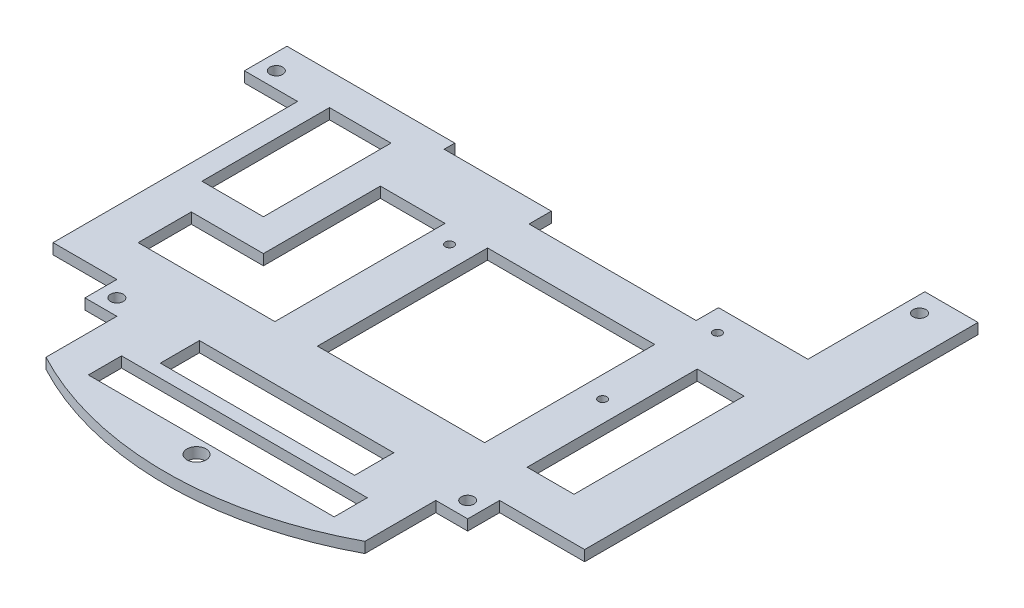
ISO-10303-21;
HEADER;
FILE_DESCRIPTION(('STEP AP214'),'2;1');
FILE_NAME('part.step','',(''),(''),'','','');
FILE_SCHEMA(('AUTOMOTIVE_DESIGN { 1 0 10303 214 1 1 1 1 }'));
ENDSEC;
DATA;
#1=APPLICATION_CONTEXT('core data for automotive mechanical design processes');
#2=APPLICATION_PROTOCOL_DEFINITION('international standard','automotive_design',2000,#1);
#3=PRODUCT_CONTEXT('',#1,'mechanical');
#4=PRODUCT('Part','Part','',(#3));
#5=PRODUCT_RELATED_PRODUCT_CATEGORY('part','',(#4));
#6=PRODUCT_DEFINITION_FORMATION('','',#4);
#7=PRODUCT_DEFINITION_CONTEXT('part definition',#1,'design');
#8=PRODUCT_DEFINITION('design','',#6,#7);
#9=PRODUCT_DEFINITION_SHAPE('','',#8);
#10=(LENGTH_UNIT() NAMED_UNIT(*) SI_UNIT(.MILLI.,.METRE.));
#11=(NAMED_UNIT(*) PLANE_ANGLE_UNIT() SI_UNIT($,.RADIAN.));
#12=(NAMED_UNIT(*) SI_UNIT($,.STERADIAN.) SOLID_ANGLE_UNIT());
#13=UNCERTAINTY_MEASURE_WITH_UNIT(LENGTH_MEASURE(1.E-05),#10,'distance_accuracy_value','');
#14=(GEOMETRIC_REPRESENTATION_CONTEXT(3) GLOBAL_UNCERTAINTY_ASSIGNED_CONTEXT((#13)) GLOBAL_UNIT_ASSIGNED_CONTEXT((#10,
#11,#12)) REPRESENTATION_CONTEXT('',''));
#15=CARTESIAN_POINT('',(0.,0.,0.));
#16=DIRECTION('',(0.,0.,1.));
#17=DIRECTION('',(1.,0.,0.));
#18=AXIS2_PLACEMENT_3D('',#15,#16,#17);
#19=CARTESIAN_POINT('',(0.,5.,0.));
#20=DIRECTION('',(0.,1.,0.));
#21=DIRECTION('',(0.,0.,1.));
#22=AXIS2_PLACEMENT_3D('',#19,#20,#21);
#23=PLANE('',#22);
#24=CARTESIAN_POINT('',(72.9562309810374,5.,27.));
#25=DIRECTION('',(0.,1.,0.));
#26=DIRECTION('',(0.,0.,1.));
#27=AXIS2_PLACEMENT_3D('',#24,#25,#26);
#28=CIRCLE('',#27,1.99999999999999);
#29=CARTESIAN_POINT('',(72.9562309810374,5.,29.));
#30=VERTEX_POINT('',#29);
#31=EDGE_CURVE('E1388',#30,#30,#28,.T.);
#32=ORIENTED_EDGE('',*,*,#31,.F.);
#33=EDGE_LOOP('',(#32));
#34=FACE_BOUND('',#33,.T.);
#35=DIRECTION('',(1.,0.,0.));
#36=VECTOR('',#35,1.);
#37=CARTESIAN_POINT('',(-110.,5.,32.5));
#38=LINE('',#37,#36);
#39=CARTESIAN_POINT('',(-110.,5.,32.5));
#40=VERTEX_POINT('',#39);
#41=CARTESIAN_POINT('',(-81.0703058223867,5.,32.5));
#42=VERTEX_POINT('',#41);
#43=EDGE_CURVE('E348',#40,#42,#38,.T.);
#44=ORIENTED_EDGE('',*,*,#43,.F.);
#45=DIRECTION('',(0.,0.,1.));
#46=VECTOR('',#45,1.);
#47=CARTESIAN_POINT('',(-110.,5.,-27.5));
#48=LINE('',#47,#46);
#49=CARTESIAN_POINT('',(-110.,5.,-27.5));
#50=VERTEX_POINT('',#49);
#51=EDGE_CURVE('E340',#50,#40,#48,.T.);
#52=ORIENTED_EDGE('',*,*,#51,.F.);
#53=DIRECTION('',(-1.,0.,0.));
#54=VECTOR('',#53,1.);
#55=CARTESIAN_POINT('',(-110.,5.,-27.5));
#56=LINE('',#55,#54);
#57=CARTESIAN_POINT('',(-81.0703058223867,5.,-27.5));
#58=VERTEX_POINT('',#57);
#59=EDGE_CURVE('E363',#58,#50,#56,.T.);
#60=ORIENTED_EDGE('',*,*,#59,.F.);
#61=DIRECTION('',(0.,0.,-1.));
#62=VECTOR('',#61,1.);
#63=CARTESIAN_POINT('',(-81.0703058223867,5.,-27.5));
#64=LINE('',#63,#62);
#65=EDGE_CURVE('E361',#42,#58,#64,.T.);
#66=ORIENTED_EDGE('',*,*,#65,.F.);
#67=EDGE_LOOP('',(#44,#52,#60,#66));
#68=FACE_BOUND('',#67,.T.);
#69=DIRECTION('',(-1.,0.,0.));
#70=VECTOR('',#69,1.);
#71=CARTESIAN_POINT('',(57.8,5.,122.510637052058));
#72=LINE('',#71,#70);
#73=CARTESIAN_POINT('',(57.8,5.,122.510637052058));
#74=VERTEX_POINT('',#73);
#75=CARTESIAN_POINT('',(-57.8,5.,122.510637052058));
#76=VERTEX_POINT('',#75);
#77=EDGE_CURVE('E387',#74,#76,#72,.T.);
#78=ORIENTED_EDGE('',*,*,#77,.F.);
#79=DIRECTION('',(0.,0.,-1.));
#80=VECTOR('',#79,1.);
#81=CARTESIAN_POINT('',(57.8,5.,138.110637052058));
#82=LINE('',#81,#80);
#83=CARTESIAN_POINT('',(57.8,5.,138.110637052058));
#84=VERTEX_POINT('',#83);
#85=EDGE_CURVE('E385',#84,#74,#82,.T.);
#86=ORIENTED_EDGE('',*,*,#85,.F.);
#87=DIRECTION('',(1.,0.,0.));
#88=VECTOR('',#87,1.);
#89=CARTESIAN_POINT('',(-57.8,5.,138.110637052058));
#90=LINE('',#89,#88);
#91=CARTESIAN_POINT('',(-57.8,5.,138.110637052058));
#92=VERTEX_POINT('',#91);
#93=EDGE_CURVE('E393',#92,#84,#90,.T.);
#94=ORIENTED_EDGE('',*,*,#93,.F.);
#95=DIRECTION('',(0.,0.,1.));
#96=VECTOR('',#95,1.);
#97=CARTESIAN_POINT('',(-57.8,5.,122.510637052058));
#98=LINE('',#97,#96);
#99=EDGE_CURVE('E390',#76,#92,#98,.T.);
#100=ORIENTED_EDGE('',*,*,#99,.F.);
#101=EDGE_LOOP('',(#78,#86,#94,#100));
#102=FACE_BOUND('',#101,.T.);
#103=CARTESIAN_POINT('',(-82.5,5.,100.));
#104=DIRECTION('',(0.,1.,0.));
#105=DIRECTION('',(0.,0.,1.));
#106=AXIS2_PLACEMENT_3D('',#103,#104,#105);
#107=CIRCLE('',#106,3.00000000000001);
#108=CARTESIAN_POINT('',(-82.5,5.,103.));
#109=VERTEX_POINT('',#108);
#110=EDGE_CURVE('E447',#109,#109,#107,.T.);
#111=ORIENTED_EDGE('',*,*,#110,.F.);
#112=EDGE_LOOP('',(#111));
#113=FACE_BOUND('',#112,.T.);
#114=CARTESIAN_POINT('',(-137.5,5.,-29.9999999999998));
#115=DIRECTION('',(0.,1.,0.));
#116=DIRECTION('',(0.,0.,1.));
#117=AXIS2_PLACEMENT_3D('',#114,#115,#116);
#118=CIRCLE('',#117,2.99999999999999);
#119=CARTESIAN_POINT('',(-137.5,5.,-26.9999999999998));
#120=VERTEX_POINT('',#119);
#121=EDGE_CURVE('E459',#120,#120,#118,.T.);
#122=ORIENTED_EDGE('',*,*,#121,.F.);
#123=EDGE_LOOP('',(#122));
#124=FACE_BOUND('',#123,.T.);
#125=DIRECTION('',(-1.,0.,0.));
#126=VECTOR('',#125,1.);
#127=CARTESIAN_POINT('',(62.9545905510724,5.,-7.50000000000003));
#128=LINE('',#127,#126);
#129=CARTESIAN_POINT('',(62.9545905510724,5.,-7.50000000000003));
#130=VERTEX_POINT('',#129);
#131=CARTESIAN_POINT('',(-15.6665204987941,5.,-7.50000000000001));
#132=VERTEX_POINT('',#131);
#133=EDGE_CURVE('E498',#130,#132,#128,.T.);
#134=ORIENTED_EDGE('',*,*,#133,.F.);
#135=DIRECTION('',(0.,0.,-1.));
#136=VECTOR('',#135,1.);
#137=CARTESIAN_POINT('',(62.9545905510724,5.,-7.50000000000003));
#138=LINE('',#137,#136);
#139=CARTESIAN_POINT('',(62.9545905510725,5.,72.5));
#140=VERTEX_POINT('',#139);
#141=EDGE_CURVE('E496',#140,#130,#138,.T.);
#142=ORIENTED_EDGE('',*,*,#141,.F.);
#143=DIRECTION('',(1.,0.,0.));
#144=VECTOR('',#143,1.);
#145=CARTESIAN_POINT('',(-15.6665204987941,5.,72.5));
#146=LINE('',#145,#144);
#147=CARTESIAN_POINT('',(-15.6665204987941,5.,72.5));
#148=VERTEX_POINT('',#147);
#149=EDGE_CURVE('E504',#148,#140,#146,.T.);
#150=ORIENTED_EDGE('',*,*,#149,.F.);
#151=DIRECTION('',(0.,0.,1.));
#152=VECTOR('',#151,1.);
#153=CARTESIAN_POINT('',(-15.6665204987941,5.,-7.50000000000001));
#154=LINE('',#153,#152);
#155=EDGE_CURVE('E501',#132,#148,#154,.T.);
#156=ORIENTED_EDGE('',*,*,#155,.F.);
#157=EDGE_LOOP('',(#134,#142,#150,#156));
#158=FACE_BOUND('',#157,.T.);
#159=DIRECTION('',(0.,0.,1.));
#160=VECTOR('',#159,1.);
#161=CARTESIAN_POINT('',(-100.,5.,47.5));
#162=LINE('',#161,#160);
#163=CARTESIAN_POINT('',(-100.,5.,47.5));
#164=VERTEX_POINT('',#163);
#165=CARTESIAN_POINT('',(-100.,5.,72.5));
#166=VERTEX_POINT('',#165);
#167=EDGE_CURVE('E535',#164,#166,#162,.T.);
#168=ORIENTED_EDGE('',*,*,#167,.F.);
#169=DIRECTION('',(-1.,0.,0.));
#170=VECTOR('',#169,1.);
#171=CARTESIAN_POINT('',(-100.,5.,47.5));
#172=LINE('',#171,#170);
#173=CARTESIAN_POINT('',(-66.0703058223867,5.,47.5));
#174=VERTEX_POINT('',#173);
#175=EDGE_CURVE('E533',#174,#164,#172,.T.);
#176=ORIENTED_EDGE('',*,*,#175,.F.);
#177=DIRECTION('',(0.,0.,1.));
#178=VECTOR('',#177,1.);
#179=CARTESIAN_POINT('',(-66.0703058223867,5.,47.5));
#180=LINE('',#179,#178);
#181=CARTESIAN_POINT('',(-66.0703058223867,5.,-7.5));
#182=VERTEX_POINT('',#181);
#183=EDGE_CURVE('E545',#182,#174,#180,.T.);
#184=ORIENTED_EDGE('',*,*,#183,.F.);
#185=DIRECTION('',(-1.,0.,0.));
#186=VECTOR('',#185,1.);
#187=CARTESIAN_POINT('',(-35.6665204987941,5.,-7.50000000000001));
#188=LINE('',#187,#186);
#189=CARTESIAN_POINT('',(-35.6665204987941,5.,-7.50000000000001));
#190=VERTEX_POINT('',#189);
#191=EDGE_CURVE('E542',#190,#182,#188,.T.);
#192=ORIENTED_EDGE('',*,*,#191,.F.);
#193=DIRECTION('',(0.,0.,-1.));
#194=VECTOR('',#193,1.);
#195=CARTESIAN_POINT('',(-35.6665204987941,5.,-7.50000000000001));
#196=LINE('',#195,#194);
#197=CARTESIAN_POINT('',(-35.6665204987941,5.,72.5));
#198=VERTEX_POINT('',#197);
#199=EDGE_CURVE('E540',#198,#190,#196,.T.);
#200=ORIENTED_EDGE('',*,*,#199,.F.);
#201=DIRECTION('',(1.,0.,0.));
#202=VECTOR('',#201,1.);
#203=CARTESIAN_POINT('',(-100.,5.,72.5));
#204=LINE('',#203,#202);
#205=EDGE_CURVE('E538',#166,#198,#204,.T.);
#206=ORIENTED_EDGE('',*,*,#205,.F.);
#207=EDGE_LOOP('',(#168,#176,#184,#192,#200,#206));
#208=FACE_BOUND('',#207,.T.);
#209=DIRECTION('',(0.,0.,1.));
#210=VECTOR('',#209,1.);
#211=CARTESIAN_POINT('',(-145.,5.,-37.4999999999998));
#212=LINE('',#211,#210);
#213=CARTESIAN_POINT('',(-145.,5.,-42.5));
#214=VERTEX_POINT('',#213);
#215=CARTESIAN_POINT('',(-145.,5.,-22.4999999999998));
#216=VERTEX_POINT('',#215);
#217=EDGE_CURVE('E578',#214,#216,#212,.T.);
#218=ORIENTED_EDGE('',*,*,#217,.T.);
#219=DIRECTION('',(1.,0.,0.));
#220=VECTOR('',#219,1.);
#221=CARTESIAN_POINT('',(-120.,5.,-22.4999999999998));
#222=LINE('',#221,#220);
#223=CARTESIAN_POINT('',(-120.,5.,-22.4999999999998));
#224=VERTEX_POINT('',#223);
#225=EDGE_CURVE('E580',#216,#224,#222,.T.);
#226=ORIENTED_EDGE('',*,*,#225,.T.);
#227=DIRECTION('',(0.,0.,1.));
#228=VECTOR('',#227,1.);
#229=CARTESIAN_POINT('',(-120.,5.,27.5));
#230=LINE('',#229,#228);
#231=CARTESIAN_POINT('',(-120.,5.,92.5));
#232=VERTEX_POINT('',#231);
#233=EDGE_CURVE('E583',#224,#232,#230,.T.);
#234=ORIENTED_EDGE('',*,*,#233,.T.);
#235=DIRECTION('',(1.,0.,0.));
#236=VECTOR('',#235,1.);
#237=CARTESIAN_POINT('',(-120.,5.,92.5));
#238=LINE('',#237,#236);
#239=CARTESIAN_POINT('',(-90.,5.,92.5));
#240=VERTEX_POINT('',#239);
#241=EDGE_CURVE('E585',#232,#240,#238,.T.);
#242=ORIENTED_EDGE('',*,*,#241,.T.);
#243=DIRECTION('',(0.,0.,1.));
#244=VECTOR('',#243,1.);
#245=CARTESIAN_POINT('',(-90.,5.,92.5));
#246=LINE('',#245,#244);
#247=CARTESIAN_POINT('',(-90.,5.,107.5));
#248=VERTEX_POINT('',#247);
#249=EDGE_CURVE('E587',#240,#248,#246,.T.);
#250=ORIENTED_EDGE('',*,*,#249,.T.);
#251=DIRECTION('',(1.,0.,0.));
#252=VECTOR('',#251,1.);
#253=CARTESIAN_POINT('',(-90.,5.,107.5));
#254=LINE('',#253,#252);
#255=CARTESIAN_POINT('',(-75.,5.,107.5));
#256=VERTEX_POINT('',#255);
#257=EDGE_CURVE('E589',#248,#256,#254,.T.);
#258=ORIENTED_EDGE('',*,*,#257,.T.);
#259=DIRECTION('',(0.,0.,1.));
#260=VECTOR('',#259,1.);
#261=CARTESIAN_POINT('',(-75.,5.,107.5));
#262=LINE('',#261,#260);
#263=CARTESIAN_POINT('',(-75.,5.,140.823471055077));
#264=VERTEX_POINT('',#263);
#265=EDGE_CURVE('E591',#256,#264,#262,.T.);
#266=ORIENTED_EDGE('',*,*,#265,.T.);
#267=CARTESIAN_POINT('',(0.,5.,0.));
#268=DIRECTION('',(0.,1.,0.));
#269=DIRECTION('',(0.,0.,1.));
#270=AXIS2_PLACEMENT_3D('',#267,#268,#269);
#271=CIRCLE('',#270,159.550148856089);
#272=CARTESIAN_POINT('',(75.,5.,140.823471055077));
#273=VERTEX_POINT('',#272);
#274=EDGE_CURVE('E593',#264,#273,#271,.T.);
#275=ORIENTED_EDGE('',*,*,#274,.T.);
#276=DIRECTION('',(0.,0.,-1.));
#277=VECTOR('',#276,1.);
#278=CARTESIAN_POINT('',(75.,5.,140.823471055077));
#279=LINE('',#278,#277);
#280=CARTESIAN_POINT('',(75.,5.,107.5));
#281=VERTEX_POINT('',#280);
#282=EDGE_CURVE('E595',#273,#281,#279,.T.);
#283=ORIENTED_EDGE('',*,*,#282,.T.);
#284=DIRECTION('',(1.,0.,0.));
#285=VECTOR('',#284,1.);
#286=CARTESIAN_POINT('',(75.,5.,107.5));
#287=LINE('',#286,#285);
#288=CARTESIAN_POINT('',(90.,5.,107.5));
#289=VERTEX_POINT('',#288);
#290=EDGE_CURVE('E597',#281,#289,#287,.T.);
#291=ORIENTED_EDGE('',*,*,#290,.T.);
#292=DIRECTION('',(0.,0.,-1.));
#293=VECTOR('',#292,1.);
#294=CARTESIAN_POINT('',(90.,5.,107.5));
#295=LINE('',#294,#293);
#296=CARTESIAN_POINT('',(90.,5.,92.5));
#297=VERTEX_POINT('',#296);
#298=EDGE_CURVE('E599',#289,#297,#295,.T.);
#299=ORIENTED_EDGE('',*,*,#298,.T.);
#300=DIRECTION('',(1.,0.,0.));
#301=VECTOR('',#300,1.);
#302=CARTESIAN_POINT('',(90.,5.,92.5));
#303=LINE('',#302,#301);
#304=CARTESIAN_POINT('',(130.,5.,92.5));
#305=VERTEX_POINT('',#304);
#306=EDGE_CURVE('E601',#297,#305,#303,.T.);
#307=ORIENTED_EDGE('',*,*,#306,.T.);
#308=DIRECTION('',(0.,0.,-1.));
#309=VECTOR('',#308,1.);
#310=CARTESIAN_POINT('',(130.,5.,92.5));
#311=LINE('',#310,#309);
#312=CARTESIAN_POINT('',(130.,5.,-92.5));
#313=VERTEX_POINT('',#312);
#314=EDGE_CURVE('E603',#305,#313,#311,.T.);
#315=ORIENTED_EDGE('',*,*,#314,.T.);
#316=DIRECTION('',(-1.,0.,0.));
#317=VECTOR('',#316,1.);
#318=CARTESIAN_POINT('',(130.,5.,-92.5));
#319=LINE('',#318,#317);
#320=CARTESIAN_POINT('',(105.,5.,-92.4999999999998));
#321=VERTEX_POINT('',#320);
#322=EDGE_CURVE('E605',#313,#321,#319,.T.);
#323=ORIENTED_EDGE('',*,*,#322,.T.);
#324=DIRECTION('',(0.,0.,1.));
#325=VECTOR('',#324,1.);
#326=CARTESIAN_POINT('',(105.,5.,-92.4999999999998));
#327=LINE('',#326,#325);
#328=CARTESIAN_POINT('',(105.,5.,-37.5));
#329=VERTEX_POINT('',#328);
#330=EDGE_CURVE('E607',#321,#329,#327,.T.);
#331=ORIENTED_EDGE('',*,*,#330,.T.);
#332=DIRECTION('',(-1.,0.,0.));
#333=VECTOR('',#332,1.);
#334=CARTESIAN_POINT('',(105.,5.,-37.5));
#335=LINE('',#334,#333);
#336=CARTESIAN_POINT('',(62.9545905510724,5.,-37.4999999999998));
#337=VERTEX_POINT('',#336);
#338=EDGE_CURVE('E609',#329,#337,#335,.T.);
#339=ORIENTED_EDGE('',*,*,#338,.T.);
#340=DIRECTION('',(0.,0.,1.));
#341=VECTOR('',#340,1.);
#342=CARTESIAN_POINT('',(62.9545905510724,5.,-37.4999999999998));
#343=LINE('',#342,#341);
#344=CARTESIAN_POINT('',(62.9545905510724,5.,-27.));
#345=VERTEX_POINT('',#344);
#346=EDGE_CURVE('E611',#337,#345,#343,.T.);
#347=ORIENTED_EDGE('',*,*,#346,.T.);
#348=DIRECTION('',(-1.,0.,0.));
#349=VECTOR('',#348,1.);
#350=CARTESIAN_POINT('',(-15.6665204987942,5.,-27.));
#351=LINE('',#350,#349);
#352=CARTESIAN_POINT('',(-15.6665204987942,5.,-27.));
#353=VERTEX_POINT('',#352);
#354=EDGE_CURVE('E613',#345,#353,#351,.T.);
#355=ORIENTED_EDGE('',*,*,#354,.T.);
#356=DIRECTION('',(0.,0.,-1.));
#357=VECTOR('',#356,1.);
#358=CARTESIAN_POINT('',(-15.6665204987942,5.,-37.4999999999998));
#359=LINE('',#358,#357);
#360=CARTESIAN_POINT('',(-15.6665204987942,5.,-37.4999999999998));
#361=VERTEX_POINT('',#360);
#362=EDGE_CURVE('E615',#353,#361,#359,.T.);
#363=ORIENTED_EDGE('',*,*,#362,.T.);
#364=DIRECTION('',(-1.,0.,0.));
#365=VECTOR('',#364,1.);
#366=CARTESIAN_POINT('',(-15.6665204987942,5.,-37.4999999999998));
#367=LINE('',#366,#365);
#368=CARTESIAN_POINT('',(-66.0703058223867,5.,-37.4999999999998));
#369=VERTEX_POINT('',#368);
#370=EDGE_CURVE('E617',#361,#369,#367,.T.);
#371=ORIENTED_EDGE('',*,*,#370,.T.);
#372=DIRECTION('',(0.,0.,-1.));
#373=VECTOR('',#372,1.);
#374=CARTESIAN_POINT('',(-66.0703058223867,5.,-37.4999999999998));
#375=LINE('',#374,#373);
#376=CARTESIAN_POINT('',(-66.0703058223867,5.,-42.5));
#377=VERTEX_POINT('',#376);
#378=EDGE_CURVE('E619',#369,#377,#375,.T.);
#379=ORIENTED_EDGE('',*,*,#378,.T.);
#380=DIRECTION('',(-1.,0.,0.));
#381=VECTOR('',#380,1.);
#382=CARTESIAN_POINT('',(-145.,5.,-42.5));
#383=LINE('',#382,#381);
#384=EDGE_CURVE('E621',#377,#214,#383,.T.);
#385=ORIENTED_EDGE('',*,*,#384,.T.);
#386=EDGE_LOOP('',(#218,#226,#234,#242,#250,#258,#266,#275,#283,#291,#299,#307,#315,#323,#331,
#339,#347,#355,#363,#371,#379,#385));
#387=FACE_BOUND('',#386,.T.);
#388=CARTESIAN_POINT('',(112.5,5.,-82.5000000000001));
#389=DIRECTION('',(0.,1.,0.));
#390=DIRECTION('',(0.,0.,1.));
#391=AXIS2_PLACEMENT_3D('',#388,#389,#390);
#392=CIRCLE('',#391,3.00000000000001);
#393=CARTESIAN_POINT('',(112.5,5.,-79.5000000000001));
#394=VERTEX_POINT('',#393);
#395=EDGE_CURVE('E527',#394,#394,#392,.T.);
#396=ORIENTED_EDGE('',*,*,#395,.F.);
#397=EDGE_LOOP('',(#396));
#398=FACE_BOUND('',#397,.T.);
#399=DIRECTION('',(1.,0.,0.));
#400=VECTOR('',#399,1.);
#401=CARTESIAN_POINT('',(82.9545905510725,5.,72.5));
#402=LINE('',#401,#400);
#403=CARTESIAN_POINT('',(82.9545905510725,5.,72.5));
#404=VERTEX_POINT('',#403);
#405=CARTESIAN_POINT('',(105.,5.,72.5));
#406=VERTEX_POINT('',#405);
#407=EDGE_CURVE('E467',#404,#406,#402,.T.);
#408=ORIENTED_EDGE('',*,*,#407,.F.);
#409=DIRECTION('',(0.,0.,1.));
#410=VECTOR('',#409,1.);
#411=CARTESIAN_POINT('',(82.9545905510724,5.,-7.50000000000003));
#412=LINE('',#411,#410);
#413=CARTESIAN_POINT('',(82.9545905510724,5.,-7.50000000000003));
#414=VERTEX_POINT('',#413);
#415=EDGE_CURVE('E465',#414,#404,#412,.T.);
#416=ORIENTED_EDGE('',*,*,#415,.F.);
#417=DIRECTION('',(-1.,0.,0.));
#418=VECTOR('',#417,1.);
#419=CARTESIAN_POINT('',(105.,5.,-7.50000000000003));
#420=LINE('',#419,#418);
#421=CARTESIAN_POINT('',(105.,5.,-7.50000000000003));
#422=VERTEX_POINT('',#421);
#423=EDGE_CURVE('E473',#422,#414,#420,.T.);
#424=ORIENTED_EDGE('',*,*,#423,.F.);
#425=DIRECTION('',(0.,0.,-1.));
#426=VECTOR('',#425,1.);
#427=CARTESIAN_POINT('',(105.,5.,72.5));
#428=LINE('',#427,#426);
#429=EDGE_CURVE('E470',#406,#422,#428,.T.);
#430=ORIENTED_EDGE('',*,*,#429,.F.);
#431=EDGE_LOOP('',(#408,#416,#424,#430));
#432=FACE_BOUND('',#431,.T.);
#433=CARTESIAN_POINT('',(82.5,5.,100.));
#434=DIRECTION('',(0.,1.,0.));
#435=DIRECTION('',(0.,0.,1.));
#436=AXIS2_PLACEMENT_3D('',#433,#434,#435);
#437=CIRCLE('',#436,3.00000000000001);
#438=CARTESIAN_POINT('',(82.5,5.,103.));
#439=VERTEX_POINT('',#438);
#440=EDGE_CURVE('E453',#439,#439,#437,.T.);
#441=ORIENTED_EDGE('',*,*,#440,.F.);
#442=EDGE_LOOP('',(#441));
#443=FACE_BOUND('',#442,.T.);
#444=DIRECTION('',(0.,0.,-1.));
#445=VECTOR('',#444,1.);
#446=CARTESIAN_POINT('',(45.7,5.,116.363021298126));
#447=LINE('',#446,#445);
#448=CARTESIAN_POINT('',(45.7,5.,116.363021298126));
#449=VERTEX_POINT('',#448);
#450=CARTESIAN_POINT('',(45.7,5.,97.9630212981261));
#451=VERTEX_POINT('',#450);
#452=EDGE_CURVE('E418',#449,#451,#447,.T.);
#453=ORIENTED_EDGE('',*,*,#452,.F.);
#454=DIRECTION('',(1.,0.,0.));
#455=VECTOR('',#454,1.);
#456=CARTESIAN_POINT('',(-45.7,5.,116.363021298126));
#457=LINE('',#456,#455);
#458=CARTESIAN_POINT('',(-45.7,5.,116.363021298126));
#459=VERTEX_POINT('',#458);
#460=EDGE_CURVE('E416',#459,#449,#457,.T.);
#461=ORIENTED_EDGE('',*,*,#460,.F.);
#462=DIRECTION('',(0.,0.,1.));
#463=VECTOR('',#462,1.);
#464=CARTESIAN_POINT('',(-45.7,5.,97.9630212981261));
#465=LINE('',#464,#463);
#466=CARTESIAN_POINT('',(-45.7,5.,97.9630212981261));
#467=VERTEX_POINT('',#466);
#468=EDGE_CURVE('E424',#467,#459,#465,.T.);
#469=ORIENTED_EDGE('',*,*,#468,.F.);
#470=DIRECTION('',(-1.,0.,0.));
#471=VECTOR('',#470,1.);
#472=CARTESIAN_POINT('',(45.7,5.,97.9630212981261));
#473=LINE('',#472,#471);
#474=EDGE_CURVE('E421',#451,#467,#473,.T.);
#475=ORIENTED_EDGE('',*,*,#474,.F.);
#476=EDGE_LOOP('',(#453,#461,#469,#475));
#477=FACE_BOUND('',#476,.T.);
#478=CARTESIAN_POINT('',(0.,5.,145.0269592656));
#479=DIRECTION('',(0.,1.,0.));
#480=DIRECTION('',(0.,0.,1.));
#481=AXIS2_PLACEMENT_3D('',#478,#479,#480);
#482=CIRCLE('',#481,4.5);
#483=CARTESIAN_POINT('',(0.,5.,149.5269592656));
#484=VERTEX_POINT('',#483);
#485=EDGE_CURVE('E379',#484,#484,#482,.T.);
#486=ORIENTED_EDGE('',*,*,#485,.F.);
#487=EDGE_LOOP('',(#486));
#488=FACE_BOUND('',#487,.T.);
#489=CARTESIAN_POINT('',(-26.0437690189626,5.,0.));
#490=DIRECTION('',(0.,1.,0.));
#491=DIRECTION('',(0.,0.,1.));
#492=AXIS2_PLACEMENT_3D('',#489,#490,#491);
#493=CIRCLE('',#492,2.00000000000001);
#494=CARTESIAN_POINT('',(-26.0437690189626,5.,1.99999999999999));
#495=VERTEX_POINT('',#494);
#496=EDGE_CURVE('E369',#495,#495,#493,.T.);
#497=ORIENTED_EDGE('',*,*,#496,.F.);
#498=EDGE_LOOP('',(#497));
#499=FACE_BOUND('',#498,.T.);
#500=CARTESIAN_POINT('',(72.9562309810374,5.,-27.));
#501=DIRECTION('',(0.,1.,0.));
#502=DIRECTION('',(0.,0.,1.));
#503=AXIS2_PLACEMENT_3D('',#500,#501,#502);
#504=CIRCLE('',#503,1.99999999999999);
#505=CARTESIAN_POINT('',(72.9562309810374,5.,-25.));
#506=VERTEX_POINT('',#505);
#507=EDGE_CURVE('E1379',#506,#506,#504,.T.);
#508=ORIENTED_EDGE('',*,*,#507,.F.);
#509=EDGE_LOOP('',(#508));
#510=FACE_BOUND('',#509,.T.);
#511=ADVANCED_FACE('F35',(#34,#68,#102,#113,#124,#158,#208,#387,#398,#432,#443,#477,#488,#499,
#510),#23,.T.);
#512=CARTESIAN_POINT('',(0.,0.,0.));
#513=DIRECTION('',(0.,1.,0.));
#514=DIRECTION('',(0.,0.,1.));
#515=AXIS2_PLACEMENT_3D('',#512,#513,#514);
#516=PLANE('',#515);
#517=CARTESIAN_POINT('',(72.9562309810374,0.,27.));
#518=DIRECTION('',(0.,1.,0.));
#519=DIRECTION('',(0.,0.,1.));
#520=AXIS2_PLACEMENT_3D('',#517,#518,#519);
#521=CIRCLE('',#520,1.99999999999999);
#522=CARTESIAN_POINT('',(72.9562309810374,0.,29.));
#523=VERTEX_POINT('',#522);
#524=EDGE_CURVE('E1385',#523,#523,#521,.T.);
#525=ORIENTED_EDGE('',*,*,#524,.T.);
#526=EDGE_LOOP('',(#525));
#527=FACE_BOUND('',#526,.T.);
#528=DIRECTION('',(0.,0.,1.));
#529=VECTOR('',#528,1.);
#530=CARTESIAN_POINT('',(-110.,0.,-27.5));
#531=LINE('',#530,#529);
#532=CARTESIAN_POINT('',(-110.,0.,-27.5));
#533=VERTEX_POINT('',#532);
#534=CARTESIAN_POINT('',(-110.,0.,32.5));
#535=VERTEX_POINT('',#534);
#536=EDGE_CURVE('E58',#533,#535,#531,.T.);
#537=ORIENTED_EDGE('',*,*,#536,.T.);
#538=DIRECTION('',(1.,0.,0.));
#539=VECTOR('',#538,1.);
#540=CARTESIAN_POINT('',(-110.,0.,32.5));
#541=LINE('',#540,#539);
#542=CARTESIAN_POINT('',(-81.0703058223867,0.,32.5));
#543=VERTEX_POINT('',#542);
#544=EDGE_CURVE('E355',#535,#543,#541,.T.);
#545=ORIENTED_EDGE('',*,*,#544,.T.);
#546=DIRECTION('',(0.,0.,-1.));
#547=VECTOR('',#546,1.);
#548=CARTESIAN_POINT('',(-81.0703058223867,0.,-27.5));
#549=LINE('',#548,#547);
#550=CARTESIAN_POINT('',(-81.0703058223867,0.,-27.5));
#551=VERTEX_POINT('',#550);
#552=EDGE_CURVE('E371',#543,#551,#549,.T.);
#553=ORIENTED_EDGE('',*,*,#552,.T.);
#554=DIRECTION('',(-1.,0.,0.));
#555=VECTOR('',#554,1.);
#556=CARTESIAN_POINT('',(-110.,0.,-27.5));
#557=LINE('',#556,#555);
#558=EDGE_CURVE('E349',#551,#533,#557,.T.);
#559=ORIENTED_EDGE('',*,*,#558,.T.);
#560=EDGE_LOOP('',(#537,#545,#553,#559));
#561=FACE_BOUND('',#560,.T.);
#562=DIRECTION('',(0.,0.,-1.));
#563=VECTOR('',#562,1.);
#564=CARTESIAN_POINT('',(57.8,0.,138.110637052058));
#565=LINE('',#564,#563);
#566=CARTESIAN_POINT('',(57.8,0.,138.110637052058));
#567=VERTEX_POINT('',#566);
#568=CARTESIAN_POINT('',(57.8,0.,122.510637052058));
#569=VERTEX_POINT('',#568);
#570=EDGE_CURVE('E382',#567,#569,#565,.T.);
#571=ORIENTED_EDGE('',*,*,#570,.T.);
#572=DIRECTION('',(-1.,0.,0.));
#573=VECTOR('',#572,1.);
#574=CARTESIAN_POINT('',(57.8,0.,122.510637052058));
#575=LINE('',#574,#573);
#576=CARTESIAN_POINT('',(-57.8,0.,122.510637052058));
#577=VERTEX_POINT('',#576);
#578=EDGE_CURVE('E398',#569,#577,#575,.T.);
#579=ORIENTED_EDGE('',*,*,#578,.T.);
#580=DIRECTION('',(0.,0.,1.));
#581=VECTOR('',#580,1.);
#582=CARTESIAN_POINT('',(-57.8,0.,122.510637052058));
#583=LINE('',#582,#581);
#584=CARTESIAN_POINT('',(-57.8,0.,138.110637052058));
#585=VERTEX_POINT('',#584);
#586=EDGE_CURVE('E401',#577,#585,#583,.T.);
#587=ORIENTED_EDGE('',*,*,#586,.T.);
#588=DIRECTION('',(1.,0.,0.));
#589=VECTOR('',#588,1.);
#590=CARTESIAN_POINT('',(-57.8,0.,138.110637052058));
#591=LINE('',#590,#589);
#592=EDGE_CURVE('E388',#585,#567,#591,.T.);
#593=ORIENTED_EDGE('',*,*,#592,.T.);
#594=EDGE_LOOP('',(#571,#579,#587,#593));
#595=FACE_BOUND('',#594,.T.);
#596=CARTESIAN_POINT('',(-82.5,0.,100.));
#597=DIRECTION('',(0.,1.,0.));
#598=DIRECTION('',(0.,0.,1.));
#599=AXIS2_PLACEMENT_3D('',#596,#597,#598);
#600=CIRCLE('',#599,3.00000000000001);
#601=CARTESIAN_POINT('',(-82.5,0.,103.));
#602=VERTEX_POINT('',#601);
#603=EDGE_CURVE('E446',#602,#602,#600,.T.);
#604=ORIENTED_EDGE('',*,*,#603,.T.);
#605=EDGE_LOOP('',(#604));
#606=FACE_BOUND('',#605,.T.);
#607=CARTESIAN_POINT('',(-137.5,0.,-29.9999999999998));
#608=DIRECTION('',(0.,1.,0.));
#609=DIRECTION('',(0.,0.,1.));
#610=AXIS2_PLACEMENT_3D('',#607,#608,#609);
#611=CIRCLE('',#610,2.99999999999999);
#612=CARTESIAN_POINT('',(-137.5,0.,-26.9999999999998));
#613=VERTEX_POINT('',#612);
#614=EDGE_CURVE('E456',#613,#613,#611,.T.);
#615=ORIENTED_EDGE('',*,*,#614,.T.);
#616=EDGE_LOOP('',(#615));
#617=FACE_BOUND('',#616,.T.);
#618=DIRECTION('',(0.,0.,-1.));
#619=VECTOR('',#618,1.);
#620=CARTESIAN_POINT('',(62.9545905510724,0.,-7.50000000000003));
#621=LINE('',#620,#619);
#622=CARTESIAN_POINT('',(62.9545905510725,0.,72.5));
#623=VERTEX_POINT('',#622);
#624=CARTESIAN_POINT('',(62.9545905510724,0.,-7.50000000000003));
#625=VERTEX_POINT('',#624);
#626=EDGE_CURVE('E495',#623,#625,#621,.T.);
#627=ORIENTED_EDGE('',*,*,#626,.T.);
#628=DIRECTION('',(-1.,0.,0.));
#629=VECTOR('',#628,1.);
#630=CARTESIAN_POINT('',(62.9545905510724,0.,-7.50000000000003));
#631=LINE('',#630,#629);
#632=CARTESIAN_POINT('',(-15.6665204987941,0.,-7.50000000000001));
#633=VERTEX_POINT('',#632);
#634=EDGE_CURVE('E509',#625,#633,#631,.T.);
#635=ORIENTED_EDGE('',*,*,#634,.T.);
#636=DIRECTION('',(0.,0.,1.));
#637=VECTOR('',#636,1.);
#638=CARTESIAN_POINT('',(-15.6665204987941,0.,-7.50000000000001));
#639=LINE('',#638,#637);
#640=CARTESIAN_POINT('',(-15.6665204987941,0.,72.5));
#641=VERTEX_POINT('',#640);
#642=EDGE_CURVE('E512',#633,#641,#639,.T.);
#643=ORIENTED_EDGE('',*,*,#642,.T.);
#644=DIRECTION('',(1.,0.,0.));
#645=VECTOR('',#644,1.);
#646=CARTESIAN_POINT('',(-15.6665204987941,0.,72.5));
#647=LINE('',#646,#645);
#648=EDGE_CURVE('E499',#641,#623,#647,.T.);
#649=ORIENTED_EDGE('',*,*,#648,.T.);
#650=EDGE_LOOP('',(#627,#635,#643,#649));
#651=FACE_BOUND('',#650,.T.);
#652=DIRECTION('',(-1.,0.,0.));
#653=VECTOR('',#652,1.);
#654=CARTESIAN_POINT('',(-100.,0.,47.5));
#655=LINE('',#654,#653);
#656=CARTESIAN_POINT('',(-66.0703058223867,0.,47.5));
#657=VERTEX_POINT('',#656);
#658=CARTESIAN_POINT('',(-100.,0.,47.5));
#659=VERTEX_POINT('',#658);
#660=EDGE_CURVE('E530',#657,#659,#655,.T.);
#661=ORIENTED_EDGE('',*,*,#660,.T.);
#662=DIRECTION('',(0.,0.,1.));
#663=VECTOR('',#662,1.);
#664=CARTESIAN_POINT('',(-100.,0.,47.5));
#665=LINE('',#664,#663);
#666=CARTESIAN_POINT('',(-100.,0.,72.5));
#667=VERTEX_POINT('',#666);
#668=EDGE_CURVE('E550',#659,#667,#665,.T.);
#669=ORIENTED_EDGE('',*,*,#668,.T.);
#670=DIRECTION('',(1.,0.,0.));
#671=VECTOR('',#670,1.);
#672=CARTESIAN_POINT('',(-100.,0.,72.5));
#673=LINE('',#672,#671);
#674=CARTESIAN_POINT('',(-35.6665204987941,0.,72.5));
#675=VERTEX_POINT('',#674);
#676=EDGE_CURVE('E553',#667,#675,#673,.T.);
#677=ORIENTED_EDGE('',*,*,#676,.T.);
#678=DIRECTION('',(0.,0.,-1.));
#679=VECTOR('',#678,1.);
#680=CARTESIAN_POINT('',(-35.6665204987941,0.,-7.50000000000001));
#681=LINE('',#680,#679);
#682=CARTESIAN_POINT('',(-35.6665204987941,0.,-7.50000000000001));
#683=VERTEX_POINT('',#682);
#684=EDGE_CURVE('E556',#675,#683,#681,.T.);
#685=ORIENTED_EDGE('',*,*,#684,.T.);
#686=DIRECTION('',(-1.,0.,0.));
#687=VECTOR('',#686,1.);
#688=CARTESIAN_POINT('',(-35.6665204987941,0.,-7.50000000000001));
#689=LINE('',#688,#687);
#690=CARTESIAN_POINT('',(-66.0703058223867,0.,-7.5));
#691=VERTEX_POINT('',#690);
#692=EDGE_CURVE('E559',#683,#691,#689,.T.);
#693=ORIENTED_EDGE('',*,*,#692,.T.);
#694=DIRECTION('',(0.,0.,1.));
#695=VECTOR('',#694,1.);
#696=CARTESIAN_POINT('',(-66.0703058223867,0.,47.5));
#697=LINE('',#696,#695);
#698=EDGE_CURVE('E536',#691,#657,#697,.T.);
#699=ORIENTED_EDGE('',*,*,#698,.T.);
#700=EDGE_LOOP('',(#661,#669,#677,#685,#693,#699));
#701=FACE_BOUND('',#700,.T.);
#702=DIRECTION('',(0.,0.,1.));
#703=VECTOR('',#702,1.);
#704=CARTESIAN_POINT('',(-145.,0.,-37.4999999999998));
#705=LINE('',#704,#703);
#706=CARTESIAN_POINT('',(-145.,0.,-42.5));
#707=VERTEX_POINT('',#706);
#708=CARTESIAN_POINT('',(-145.,0.,-22.4999999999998));
#709=VERTEX_POINT('',#708);
#710=EDGE_CURVE('E577',#707,#709,#705,.T.);
#711=ORIENTED_EDGE('',*,*,#710,.F.);
#712=DIRECTION('',(-1.,0.,0.));
#713=VECTOR('',#712,1.);
#714=CARTESIAN_POINT('',(-145.,0.,-42.5));
#715=LINE('',#714,#713);
#716=CARTESIAN_POINT('',(-66.0703058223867,0.,-42.5));
#717=VERTEX_POINT('',#716);
#718=EDGE_CURVE('E581',#717,#707,#715,.T.);
#719=ORIENTED_EDGE('',*,*,#718,.F.);
#720=DIRECTION('',(0.,0.,-1.));
#721=VECTOR('',#720,1.);
#722=CARTESIAN_POINT('',(-66.0703058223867,0.,-37.4999999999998));
#723=LINE('',#722,#721);
#724=CARTESIAN_POINT('',(-66.0703058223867,0.,-37.4999999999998));
#725=VERTEX_POINT('',#724);
#726=EDGE_CURVE('E665',#725,#717,#723,.T.);
#727=ORIENTED_EDGE('',*,*,#726,.F.);
#728=DIRECTION('',(-1.,0.,0.));
#729=VECTOR('',#728,1.);
#730=CARTESIAN_POINT('',(-15.6665204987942,0.,-37.4999999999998));
#731=LINE('',#730,#729);
#732=CARTESIAN_POINT('',(-15.6665204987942,0.,-37.4999999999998));
#733=VERTEX_POINT('',#732);
#734=EDGE_CURVE('E663',#733,#725,#731,.T.);
#735=ORIENTED_EDGE('',*,*,#734,.F.);
#736=DIRECTION('',(0.,0.,-1.));
#737=VECTOR('',#736,1.);
#738=CARTESIAN_POINT('',(-15.6665204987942,0.,-37.4999999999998));
#739=LINE('',#738,#737);
#740=CARTESIAN_POINT('',(-15.6665204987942,0.,-27.));
#741=VERTEX_POINT('',#740);
#742=EDGE_CURVE('E661',#741,#733,#739,.T.);
#743=ORIENTED_EDGE('',*,*,#742,.F.);
#744=DIRECTION('',(-1.,0.,0.));
#745=VECTOR('',#744,1.);
#746=CARTESIAN_POINT('',(-15.6665204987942,0.,-27.));
#747=LINE('',#746,#745);
#748=CARTESIAN_POINT('',(62.9545905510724,0.,-27.));
#749=VERTEX_POINT('',#748);
#750=EDGE_CURVE('E659',#749,#741,#747,.T.);
#751=ORIENTED_EDGE('',*,*,#750,.F.);
#752=DIRECTION('',(0.,0.,1.));
#753=VECTOR('',#752,1.);
#754=CARTESIAN_POINT('',(62.9545905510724,0.,-37.4999999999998));
#755=LINE('',#754,#753);
#756=CARTESIAN_POINT('',(62.9545905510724,0.,-37.4999999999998));
#757=VERTEX_POINT('',#756);
#758=EDGE_CURVE('E657',#757,#749,#755,.T.);
#759=ORIENTED_EDGE('',*,*,#758,.F.);
#760=DIRECTION('',(-1.,0.,0.));
#761=VECTOR('',#760,1.);
#762=CARTESIAN_POINT('',(105.,0.,-37.5));
#763=LINE('',#762,#761);
#764=CARTESIAN_POINT('',(105.,0.,-37.5));
#765=VERTEX_POINT('',#764);
#766=EDGE_CURVE('E655',#765,#757,#763,.T.);
#767=ORIENTED_EDGE('',*,*,#766,.F.);
#768=DIRECTION('',(0.,0.,1.));
#769=VECTOR('',#768,1.);
#770=CARTESIAN_POINT('',(105.,0.,-92.4999999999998));
#771=LINE('',#770,#769);
#772=CARTESIAN_POINT('',(105.,0.,-92.4999999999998));
#773=VERTEX_POINT('',#772);
#774=EDGE_CURVE('E653',#773,#765,#771,.T.);
#775=ORIENTED_EDGE('',*,*,#774,.F.);
#776=DIRECTION('',(-1.,0.,0.));
#777=VECTOR('',#776,1.);
#778=CARTESIAN_POINT('',(130.,0.,-92.5));
#779=LINE('',#778,#777);
#780=CARTESIAN_POINT('',(130.,0.,-92.5));
#781=VERTEX_POINT('',#780);
#782=EDGE_CURVE('E651',#781,#773,#779,.T.);
#783=ORIENTED_EDGE('',*,*,#782,.F.);
#784=DIRECTION('',(0.,0.,-1.));
#785=VECTOR('',#784,1.);
#786=CARTESIAN_POINT('',(130.,0.,-15.0000000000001));
#787=LINE('',#786,#785);
#788=CARTESIAN_POINT('',(130.,0.,92.5));
#789=VERTEX_POINT('',#788);
#790=EDGE_CURVE('E649',#789,#781,#787,.T.);
#791=ORIENTED_EDGE('',*,*,#790,.F.);
#792=DIRECTION('',(1.,0.,0.));
#793=VECTOR('',#792,1.);
#794=CARTESIAN_POINT('',(90.,0.,92.5));
#795=LINE('',#794,#793);
#796=CARTESIAN_POINT('',(90.,0.,92.5));
#797=VERTEX_POINT('',#796);
#798=EDGE_CURVE('E646',#797,#789,#795,.T.);
#799=ORIENTED_EDGE('',*,*,#798,.F.);
#800=DIRECTION('',(0.,0.,-1.));
#801=VECTOR('',#800,1.);
#802=CARTESIAN_POINT('',(90.,0.,107.5));
#803=LINE('',#802,#801);
#804=CARTESIAN_POINT('',(90.,0.,107.5));
#805=VERTEX_POINT('',#804);
#806=EDGE_CURVE('E644',#805,#797,#803,.T.);
#807=ORIENTED_EDGE('',*,*,#806,.F.);
#808=DIRECTION('',(1.,0.,0.));
#809=VECTOR('',#808,1.);
#810=CARTESIAN_POINT('',(75.,0.,107.5));
#811=LINE('',#810,#809);
#812=CARTESIAN_POINT('',(75.,0.,107.5));
#813=VERTEX_POINT('',#812);
#814=EDGE_CURVE('E642',#813,#805,#811,.T.);
#815=ORIENTED_EDGE('',*,*,#814,.F.);
#816=DIRECTION('',(0.,0.,-1.));
#817=VECTOR('',#816,1.);
#818=CARTESIAN_POINT('',(75.,0.,140.823471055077));
#819=LINE('',#818,#817);
#820=CARTESIAN_POINT('',(75.,0.,140.823471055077));
#821=VERTEX_POINT('',#820);
#822=EDGE_CURVE('E640',#821,#813,#819,.T.);
#823=ORIENTED_EDGE('',*,*,#822,.F.);
#824=CARTESIAN_POINT('',(0.,0.,0.));
#825=DIRECTION('',(0.,1.,0.));
#826=DIRECTION('',(0.,0.,1.));
#827=AXIS2_PLACEMENT_3D('',#824,#825,#826);
#828=CIRCLE('',#827,159.550148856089);
#829=CARTESIAN_POINT('',(-75.,0.,140.823471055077));
#830=VERTEX_POINT('',#829);
#831=EDGE_CURVE('E638',#830,#821,#828,.T.);
#832=ORIENTED_EDGE('',*,*,#831,.F.);
#833=DIRECTION('',(0.,0.,1.));
#834=VECTOR('',#833,1.);
#835=CARTESIAN_POINT('',(-75.,0.,107.5));
#836=LINE('',#835,#834);
#837=CARTESIAN_POINT('',(-75.,0.,107.5));
#838=VERTEX_POINT('',#837);
#839=EDGE_CURVE('E636',#838,#830,#836,.T.);
#840=ORIENTED_EDGE('',*,*,#839,.F.);
#841=DIRECTION('',(1.,0.,0.));
#842=VECTOR('',#841,1.);
#843=CARTESIAN_POINT('',(-90.,0.,107.5));
#844=LINE('',#843,#842);
#845=CARTESIAN_POINT('',(-90.,0.,107.5));
#846=VERTEX_POINT('',#845);
#847=EDGE_CURVE('E634',#846,#838,#844,.T.);
#848=ORIENTED_EDGE('',*,*,#847,.F.);
#849=DIRECTION('',(0.,0.,1.));
#850=VECTOR('',#849,1.);
#851=CARTESIAN_POINT('',(-90.,0.,92.5));
#852=LINE('',#851,#850);
#853=CARTESIAN_POINT('',(-90.,0.,92.5));
#854=VERTEX_POINT('',#853);
#855=EDGE_CURVE('E632',#854,#846,#852,.T.);
#856=ORIENTED_EDGE('',*,*,#855,.F.);
#857=DIRECTION('',(1.,0.,0.));
#858=VECTOR('',#857,1.);
#859=CARTESIAN_POINT('',(-120.,0.,92.5));
#860=LINE('',#859,#858);
#861=CARTESIAN_POINT('',(-120.,0.,92.5));
#862=VERTEX_POINT('',#861);
#863=EDGE_CURVE('E630',#862,#854,#860,.T.);
#864=ORIENTED_EDGE('',*,*,#863,.F.);
#865=DIRECTION('',(0.,0.,1.));
#866=VECTOR('',#865,1.);
#867=CARTESIAN_POINT('',(-120.,0.,27.5));
#868=LINE('',#867,#866);
#869=CARTESIAN_POINT('',(-120.,0.,-22.4999999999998));
#870=VERTEX_POINT('',#869);
#871=EDGE_CURVE('E628',#870,#862,#868,.T.);
#872=ORIENTED_EDGE('',*,*,#871,.F.);
#873=DIRECTION('',(1.,0.,0.));
#874=VECTOR('',#873,1.);
#875=CARTESIAN_POINT('',(-120.,0.,-22.4999999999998));
#876=LINE('',#875,#874);
#877=EDGE_CURVE('E625',#709,#870,#876,.T.);
#878=ORIENTED_EDGE('',*,*,#877,.F.);
#879=EDGE_LOOP('',(#711,#719,#727,#735,#743,#751,#759,#767,#775,#783,#791,#799,#807,#815,#823,
#832,#840,#848,#856,#864,#872,#878));
#880=FACE_BOUND('',#879,.T.);
#881=CARTESIAN_POINT('',(112.5,0.,-82.5000000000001));
#882=DIRECTION('',(0.,1.,0.));
#883=DIRECTION('',(0.,0.,1.));
#884=AXIS2_PLACEMENT_3D('',#881,#882,#883);
#885=CIRCLE('',#884,3.00000000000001);
#886=CARTESIAN_POINT('',(112.5,0.,-79.5000000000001));
#887=VERTEX_POINT('',#886);
#888=EDGE_CURVE('E526',#887,#887,#885,.T.);
#889=ORIENTED_EDGE('',*,*,#888,.T.);
#890=EDGE_LOOP('',(#889));
#891=FACE_BOUND('',#890,.T.);
#892=DIRECTION('',(0.,0.,1.));
#893=VECTOR('',#892,1.);
#894=CARTESIAN_POINT('',(82.9545905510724,0.,-7.50000000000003));
#895=LINE('',#894,#893);
#896=CARTESIAN_POINT('',(82.9545905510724,0.,-7.50000000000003));
#897=VERTEX_POINT('',#896);
#898=CARTESIAN_POINT('',(82.9545905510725,0.,72.5));
#899=VERTEX_POINT('',#898);
#900=EDGE_CURVE('E462',#897,#899,#895,.T.);
#901=ORIENTED_EDGE('',*,*,#900,.T.);
#902=DIRECTION('',(1.,0.,0.));
#903=VECTOR('',#902,1.);
#904=CARTESIAN_POINT('',(82.9545905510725,0.,72.5));
#905=LINE('',#904,#903);
#906=CARTESIAN_POINT('',(105.,0.,72.5));
#907=VERTEX_POINT('',#906);
#908=EDGE_CURVE('E478',#899,#907,#905,.T.);
#909=ORIENTED_EDGE('',*,*,#908,.T.);
#910=DIRECTION('',(0.,0.,-1.));
#911=VECTOR('',#910,1.);
#912=CARTESIAN_POINT('',(105.,0.,72.5));
#913=LINE('',#912,#911);
#914=CARTESIAN_POINT('',(105.,0.,-7.50000000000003));
#915=VERTEX_POINT('',#914);
#916=EDGE_CURVE('E481',#907,#915,#913,.T.);
#917=ORIENTED_EDGE('',*,*,#916,.T.);
#918=DIRECTION('',(-1.,0.,0.));
#919=VECTOR('',#918,1.);
#920=CARTESIAN_POINT('',(105.,0.,-7.50000000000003));
#921=LINE('',#920,#919);
#922=EDGE_CURVE('E468',#915,#897,#921,.T.);
#923=ORIENTED_EDGE('',*,*,#922,.T.);
#924=EDGE_LOOP('',(#901,#909,#917,#923));
#925=FACE_BOUND('',#924,.T.);
#926=CARTESIAN_POINT('',(82.5,0.,100.));
#927=DIRECTION('',(0.,1.,0.));
#928=DIRECTION('',(0.,0.,1.));
#929=AXIS2_PLACEMENT_3D('',#926,#927,#928);
#930=CIRCLE('',#929,3.00000000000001);
#931=CARTESIAN_POINT('',(82.5,0.,103.));
#932=VERTEX_POINT('',#931);
#933=EDGE_CURVE('E450',#932,#932,#930,.T.);
#934=ORIENTED_EDGE('',*,*,#933,.T.);
#935=EDGE_LOOP('',(#934));
#936=FACE_BOUND('',#935,.T.);
#937=DIRECTION('',(1.,0.,0.));
#938=VECTOR('',#937,1.);
#939=CARTESIAN_POINT('',(-45.7,0.,116.363021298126));
#940=LINE('',#939,#938);
#941=CARTESIAN_POINT('',(-45.7,0.,116.363021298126));
#942=VERTEX_POINT('',#941);
#943=CARTESIAN_POINT('',(45.7,0.,116.363021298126));
#944=VERTEX_POINT('',#943);
#945=EDGE_CURVE('E415',#942,#944,#940,.T.);
#946=ORIENTED_EDGE('',*,*,#945,.T.);
#947=DIRECTION('',(0.,0.,-1.));
#948=VECTOR('',#947,1.);
#949=CARTESIAN_POINT('',(45.7,0.,116.363021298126));
#950=LINE('',#949,#948);
#951=CARTESIAN_POINT('',(45.7,0.,97.9630212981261));
#952=VERTEX_POINT('',#951);
#953=EDGE_CURVE('E429',#944,#952,#950,.T.);
#954=ORIENTED_EDGE('',*,*,#953,.T.);
#955=DIRECTION('',(-1.,0.,0.));
#956=VECTOR('',#955,1.);
#957=CARTESIAN_POINT('',(45.7,0.,97.9630212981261));
#958=LINE('',#957,#956);
#959=CARTESIAN_POINT('',(-45.7,0.,97.9630212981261));
#960=VERTEX_POINT('',#959);
#961=EDGE_CURVE('E432',#952,#960,#958,.T.);
#962=ORIENTED_EDGE('',*,*,#961,.T.);
#963=DIRECTION('',(0.,0.,1.));
#964=VECTOR('',#963,1.);
#965=CARTESIAN_POINT('',(-45.7,0.,97.9630212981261));
#966=LINE('',#965,#964);
#967=EDGE_CURVE('E419',#960,#942,#966,.T.);
#968=ORIENTED_EDGE('',*,*,#967,.T.);
#969=EDGE_LOOP('',(#946,#954,#962,#968));
#970=FACE_BOUND('',#969,.T.);
#971=CARTESIAN_POINT('',(0.,0.,145.0269592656));
#972=DIRECTION('',(0.,1.,0.));
#973=DIRECTION('',(0.,0.,1.));
#974=AXIS2_PLACEMENT_3D('',#971,#972,#973);
#975=CIRCLE('',#974,4.5);
#976=CARTESIAN_POINT('',(0.,0.,149.5269592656));
#977=VERTEX_POINT('',#976);
#978=EDGE_CURVE('E356',#977,#977,#975,.T.);
#979=ORIENTED_EDGE('',*,*,#978,.T.);
#980=EDGE_LOOP('',(#979));
#981=FACE_BOUND('',#980,.T.);
#982=CARTESIAN_POINT('',(-26.0437690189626,0.,0.));
#983=DIRECTION('',(0.,1.,0.));
#984=DIRECTION('',(0.,0.,1.));
#985=AXIS2_PLACEMENT_3D('',#982,#983,#984);
#986=CIRCLE('',#985,2.00000000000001);
#987=CARTESIAN_POINT('',(-26.0437690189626,0.,1.99999999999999));
#988=VERTEX_POINT('',#987);
#989=EDGE_CURVE('E1391',#988,#988,#986,.T.);
#990=ORIENTED_EDGE('',*,*,#989,.T.);
#991=EDGE_LOOP('',(#990));
#992=FACE_BOUND('',#991,.T.);
#993=CARTESIAN_POINT('',(72.9562309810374,0.,-27.));
#994=DIRECTION('',(0.,1.,0.));
#995=DIRECTION('',(0.,0.,1.));
#996=AXIS2_PLACEMENT_3D('',#993,#994,#995);
#997=CIRCLE('',#996,1.99999999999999);
#998=CARTESIAN_POINT('',(72.9562309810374,0.,-25.));
#999=VERTEX_POINT('',#998);
#1000=EDGE_CURVE('E1382',#999,#999,#997,.T.);
#1001=ORIENTED_EDGE('',*,*,#1000,.T.);
#1002=EDGE_LOOP('',(#1001));
#1003=FACE_BOUND('',#1002,.T.);
#1004=ADVANCED_FACE('F739',(#527,#561,#595,#606,#617,#651,#701,#880,#891,#925,#936,#970,#981,
#992,#1003),#516,.F.);
#1005=CARTESIAN_POINT('',(-145.,5.,-37.4999999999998));
#1006=DIRECTION('',(1.,0.,0.));
#1007=DIRECTION('',(0.,0.,-1.));
#1008=AXIS2_PLACEMENT_3D('',#1005,#1006,#1007);
#1009=PLANE('',#1008);
#1010=ORIENTED_EDGE('',*,*,#710,.T.);
#1011=DIRECTION('',(0.,-1.,0.));
#1012=VECTOR('',#1011,1.);
#1013=CARTESIAN_POINT('',(-145.,5.,-22.4999999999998));
#1014=LINE('',#1013,#1012);
#1015=EDGE_CURVE('E11',#216,#709,#1014,.T.);
#1016=ORIENTED_EDGE('',*,*,#1015,.F.);
#1017=ORIENTED_EDGE('',*,*,#217,.F.);
#1018=DIRECTION('',(0.,-1.,0.));
#1019=VECTOR('',#1018,1.);
#1020=CARTESIAN_POINT('',(-145.,5.,-42.5));
#1021=LINE('',#1020,#1019);
#1022=EDGE_CURVE('E623',#214,#707,#1021,.T.);
#1023=ORIENTED_EDGE('',*,*,#1022,.T.);
#1024=EDGE_LOOP('',(#1010,#1016,#1017,#1023));
#1025=FACE_BOUND('',#1024,.T.);
#1026=ADVANCED_FACE('F37',(#1025),#1009,.F.);
#1027=CARTESIAN_POINT('',(-120.,5.,-22.4999999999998));
#1028=DIRECTION('',(0.,0.,-1.));
#1029=DIRECTION('',(-1.,0.,0.));
#1030=AXIS2_PLACEMENT_3D('',#1027,#1028,#1029);
#1031=PLANE('',#1030);
#1032=ORIENTED_EDGE('',*,*,#877,.T.);
#1033=DIRECTION('',(0.,-1.,0.));
#1034=VECTOR('',#1033,1.);
#1035=CARTESIAN_POINT('',(-120.,5.,-22.4999999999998));
#1036=LINE('',#1035,#1034);
#1037=EDGE_CURVE('E43',#224,#870,#1036,.T.);
#1038=ORIENTED_EDGE('',*,*,#1037,.F.);
#1039=ORIENTED_EDGE('',*,*,#225,.F.);
#1040=ORIENTED_EDGE('',*,*,#1015,.T.);
#1041=EDGE_LOOP('',(#1032,#1038,#1039,#1040));
#1042=FACE_BOUND('',#1041,.T.);
#1043=ADVANCED_FACE('F735',(#1042),#1031,.F.);
#1044=CARTESIAN_POINT('',(-120.,5.,27.5));
#1045=DIRECTION('',(1.,0.,0.));
#1046=DIRECTION('',(0.,0.,-1.));
#1047=AXIS2_PLACEMENT_3D('',#1044,#1045,#1046);
#1048=PLANE('',#1047);
#1049=ORIENTED_EDGE('',*,*,#871,.T.);
#1050=DIRECTION('',(0.,-1.,0.));
#1051=VECTOR('',#1050,1.);
#1052=CARTESIAN_POINT('',(-120.,5.,92.5));
#1053=LINE('',#1052,#1051);
#1054=EDGE_CURVE('E725',#232,#862,#1053,.T.);
#1055=ORIENTED_EDGE('',*,*,#1054,.F.);
#1056=ORIENTED_EDGE('',*,*,#233,.F.);
#1057=ORIENTED_EDGE('',*,*,#1037,.T.);
#1058=EDGE_LOOP('',(#1049,#1055,#1056,#1057));
#1059=FACE_BOUND('',#1058,.T.);
#1060=ADVANCED_FACE('F731',(#1059),#1048,.F.);
#1061=CARTESIAN_POINT('',(-120.,5.,92.5));
#1062=DIRECTION('',(0.,0.,-1.));
#1063=DIRECTION('',(-1.,0.,0.));
#1064=AXIS2_PLACEMENT_3D('',#1061,#1062,#1063);
#1065=PLANE('',#1064);
#1066=ORIENTED_EDGE('',*,*,#863,.T.);
#1067=DIRECTION('',(0.,-1.,0.));
#1068=VECTOR('',#1067,1.);
#1069=CARTESIAN_POINT('',(-90.,5.,92.5));
#1070=LINE('',#1069,#1068);
#1071=EDGE_CURVE('E722',#240,#854,#1070,.T.);
#1072=ORIENTED_EDGE('',*,*,#1071,.F.);
#1073=ORIENTED_EDGE('',*,*,#241,.F.);
#1074=ORIENTED_EDGE('',*,*,#1054,.T.);
#1075=EDGE_LOOP('',(#1066,#1072,#1073,#1074));
#1076=FACE_BOUND('',#1075,.T.);
#1077=ADVANCED_FACE('F747',(#1076),#1065,.F.);
#1078=CARTESIAN_POINT('',(-90.,5.,92.5));
#1079=DIRECTION('',(1.,0.,0.));
#1080=DIRECTION('',(0.,0.,-1.));
#1081=AXIS2_PLACEMENT_3D('',#1078,#1079,#1080);
#1082=PLANE('',#1081);
#1083=ORIENTED_EDGE('',*,*,#855,.T.);
#1084=DIRECTION('',(0.,-1.,0.));
#1085=VECTOR('',#1084,1.);
#1086=CARTESIAN_POINT('',(-90.,5.,107.5));
#1087=LINE('',#1086,#1085);
#1088=EDGE_CURVE('E719',#248,#846,#1087,.T.);
#1089=ORIENTED_EDGE('',*,*,#1088,.F.);
#1090=ORIENTED_EDGE('',*,*,#249,.F.);
#1091=ORIENTED_EDGE('',*,*,#1071,.T.);
#1092=EDGE_LOOP('',(#1083,#1089,#1090,#1091));
#1093=FACE_BOUND('',#1092,.T.);
#1094=ADVANCED_FACE('F751',(#1093),#1082,.F.);
#1095=CARTESIAN_POINT('',(-90.,5.,107.5));
#1096=DIRECTION('',(0.,0.,-1.));
#1097=DIRECTION('',(-1.,0.,0.));
#1098=AXIS2_PLACEMENT_3D('',#1095,#1096,#1097);
#1099=PLANE('',#1098);
#1100=ORIENTED_EDGE('',*,*,#847,.T.);
#1101=DIRECTION('',(0.,-1.,0.));
#1102=VECTOR('',#1101,1.);
#1103=CARTESIAN_POINT('',(-75.,5.,107.5));
#1104=LINE('',#1103,#1102);
#1105=EDGE_CURVE('E716',#256,#838,#1104,.T.);
#1106=ORIENTED_EDGE('',*,*,#1105,.F.);
#1107=ORIENTED_EDGE('',*,*,#257,.F.);
#1108=ORIENTED_EDGE('',*,*,#1088,.T.);
#1109=EDGE_LOOP('',(#1100,#1106,#1107,#1108));
#1110=FACE_BOUND('',#1109,.T.);
#1111=ADVANCED_FACE('F838',(#1110),#1099,.F.);
#1112=CARTESIAN_POINT('',(-75.,5.,107.5));
#1113=DIRECTION('',(1.,0.,0.));
#1114=DIRECTION('',(0.,0.,-1.));
#1115=AXIS2_PLACEMENT_3D('',#1112,#1113,#1114);
#1116=PLANE('',#1115);
#1117=ORIENTED_EDGE('',*,*,#839,.T.);
#1118=DIRECTION('',(0.,-1.,0.));
#1119=VECTOR('',#1118,1.);
#1120=CARTESIAN_POINT('',(-75.,5.,140.823471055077));
#1121=LINE('',#1120,#1119);
#1122=EDGE_CURVE('E713',#264,#830,#1121,.T.);
#1123=ORIENTED_EDGE('',*,*,#1122,.F.);
#1124=ORIENTED_EDGE('',*,*,#265,.F.);
#1125=ORIENTED_EDGE('',*,*,#1105,.T.);
#1126=EDGE_LOOP('',(#1117,#1123,#1124,#1125));
#1127=FACE_BOUND('',#1126,.T.);
#1128=ADVANCED_FACE('F835',(#1127),#1116,.F.);
#1129=CARTESIAN_POINT('',(0.,5.,0.));
#1130=DIRECTION('',(0.,-1.,0.));
#1131=DIRECTION('',(0.,0.,-1.));
#1132=AXIS2_PLACEMENT_3D('',#1129,#1130,#1131);
#1133=CYLINDRICAL_SURFACE('',#1132,159.550148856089);
#1134=ORIENTED_EDGE('',*,*,#831,.T.);
#1135=DIRECTION('',(0.,-1.,0.));
#1136=VECTOR('',#1135,1.);
#1137=CARTESIAN_POINT('',(75.,5.,140.823471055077));
#1138=LINE('',#1137,#1136);
#1139=EDGE_CURVE('E710',#273,#821,#1138,.T.);
#1140=ORIENTED_EDGE('',*,*,#1139,.F.);
#1141=ORIENTED_EDGE('',*,*,#274,.F.);
#1142=ORIENTED_EDGE('',*,*,#1122,.T.);
#1143=EDGE_LOOP('',(#1134,#1140,#1141,#1142));
#1144=FACE_BOUND('',#1143,.T.);
#1145=ADVANCED_FACE('F831',(#1144),#1133,.T.);
#1146=CARTESIAN_POINT('',(75.,5.,140.823471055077));
#1147=DIRECTION('',(-1.,0.,0.));
#1148=DIRECTION('',(0.,0.,1.));
#1149=AXIS2_PLACEMENT_3D('',#1146,#1147,#1148);
#1150=PLANE('',#1149);
#1151=ORIENTED_EDGE('',*,*,#822,.T.);
#1152=DIRECTION('',(0.,-1.,0.));
#1153=VECTOR('',#1152,1.);
#1154=CARTESIAN_POINT('',(75.,5.,107.5));
#1155=LINE('',#1154,#1153);
#1156=EDGE_CURVE('E707',#281,#813,#1155,.T.);
#1157=ORIENTED_EDGE('',*,*,#1156,.F.);
#1158=ORIENTED_EDGE('',*,*,#282,.F.);
#1159=ORIENTED_EDGE('',*,*,#1139,.T.);
#1160=EDGE_LOOP('',(#1151,#1157,#1158,#1159));
#1161=FACE_BOUND('',#1160,.T.);
#1162=ADVANCED_FACE('F827',(#1161),#1150,.F.);
#1163=CARTESIAN_POINT('',(75.,5.,107.5));
#1164=DIRECTION('',(0.,0.,-1.));
#1165=DIRECTION('',(-1.,0.,0.));
#1166=AXIS2_PLACEMENT_3D('',#1163,#1164,#1165);
#1167=PLANE('',#1166);
#1168=ORIENTED_EDGE('',*,*,#814,.T.);
#1169=DIRECTION('',(0.,-1.,0.));
#1170=VECTOR('',#1169,1.);
#1171=CARTESIAN_POINT('',(90.,5.,107.5));
#1172=LINE('',#1171,#1170);
#1173=EDGE_CURVE('E704',#289,#805,#1172,.T.);
#1174=ORIENTED_EDGE('',*,*,#1173,.F.);
#1175=ORIENTED_EDGE('',*,*,#290,.F.);
#1176=ORIENTED_EDGE('',*,*,#1156,.T.);
#1177=EDGE_LOOP('',(#1168,#1174,#1175,#1176));
#1178=FACE_BOUND('',#1177,.T.);
#1179=ADVANCED_FACE('F822',(#1178),#1167,.F.);
#1180=CARTESIAN_POINT('',(90.,5.,107.5));
#1181=DIRECTION('',(-1.,0.,0.));
#1182=DIRECTION('',(0.,0.,1.));
#1183=AXIS2_PLACEMENT_3D('',#1180,#1181,#1182);
#1184=PLANE('',#1183);
#1185=ORIENTED_EDGE('',*,*,#806,.T.);
#1186=DIRECTION('',(0.,-1.,0.));
#1187=VECTOR('',#1186,1.);
#1188=CARTESIAN_POINT('',(90.,5.,92.5));
#1189=LINE('',#1188,#1187);
#1190=EDGE_CURVE('E701',#297,#797,#1189,.T.);
#1191=ORIENTED_EDGE('',*,*,#1190,.F.);
#1192=ORIENTED_EDGE('',*,*,#298,.F.);
#1193=ORIENTED_EDGE('',*,*,#1173,.T.);
#1194=EDGE_LOOP('',(#1185,#1191,#1192,#1193));
#1195=FACE_BOUND('',#1194,.T.);
#1196=ADVANCED_FACE('F816',(#1195),#1184,.F.);
#1197=CARTESIAN_POINT('',(90.,5.,92.5));
#1198=DIRECTION('',(0.,0.,-1.));
#1199=DIRECTION('',(-1.,0.,0.));
#1200=AXIS2_PLACEMENT_3D('',#1197,#1198,#1199);
#1201=PLANE('',#1200);
#1202=ORIENTED_EDGE('',*,*,#798,.T.);
#1203=DIRECTION('',(0.,-1.,0.));
#1204=VECTOR('',#1203,1.);
#1205=CARTESIAN_POINT('',(130.,5.,92.5));
#1206=LINE('',#1205,#1204);
#1207=EDGE_CURVE('E698',#305,#789,#1206,.T.);
#1208=ORIENTED_EDGE('',*,*,#1207,.F.);
#1209=ORIENTED_EDGE('',*,*,#306,.F.);
#1210=ORIENTED_EDGE('',*,*,#1190,.T.);
#1211=EDGE_LOOP('',(#1202,#1208,#1209,#1210));
#1212=FACE_BOUND('',#1211,.T.);
#1213=ADVANCED_FACE('F811',(#1212),#1201,.F.);
#1214=CARTESIAN_POINT('',(130.,5.,-15.0000000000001));
#1215=DIRECTION('',(-1.,0.,0.));
#1216=DIRECTION('',(0.,0.,1.));
#1217=AXIS2_PLACEMENT_3D('',#1214,#1215,#1216);
#1218=PLANE('',#1217);
#1219=ORIENTED_EDGE('',*,*,#790,.T.);
#1220=DIRECTION('',(0.,-1.,0.));
#1221=VECTOR('',#1220,1.);
#1222=CARTESIAN_POINT('',(130.,5.,-92.5));
#1223=LINE('',#1222,#1221);
#1224=EDGE_CURVE('E695',#313,#781,#1223,.T.);
#1225=ORIENTED_EDGE('',*,*,#1224,.F.);
#1226=ORIENTED_EDGE('',*,*,#314,.F.);
#1227=ORIENTED_EDGE('',*,*,#1207,.T.);
#1228=EDGE_LOOP('',(#1219,#1225,#1226,#1227));
#1229=FACE_BOUND('',#1228,.T.);
#1230=ADVANCED_FACE('F806',(#1229),#1218,.F.);
#1231=CARTESIAN_POINT('',(130.,5.,-92.5));
#1232=DIRECTION('',(0.,0.,1.));
#1233=DIRECTION('',(1.,0.,0.));
#1234=AXIS2_PLACEMENT_3D('',#1231,#1232,#1233);
#1235=PLANE('',#1234);
#1236=ORIENTED_EDGE('',*,*,#782,.T.);
#1237=DIRECTION('',(0.,-1.,0.));
#1238=VECTOR('',#1237,1.);
#1239=CARTESIAN_POINT('',(105.,5.,-92.4999999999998));
#1240=LINE('',#1239,#1238);
#1241=EDGE_CURVE('E692',#321,#773,#1240,.T.);
#1242=ORIENTED_EDGE('',*,*,#1241,.F.);
#1243=ORIENTED_EDGE('',*,*,#322,.F.);
#1244=ORIENTED_EDGE('',*,*,#1224,.T.);
#1245=EDGE_LOOP('',(#1236,#1242,#1243,#1244));
#1246=FACE_BOUND('',#1245,.T.);
#1247=ADVANCED_FACE('F802',(#1246),#1235,.F.);
#1248=CARTESIAN_POINT('',(105.,5.,-92.4999999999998));
#1249=DIRECTION('',(1.,0.,0.));
#1250=DIRECTION('',(0.,0.,-1.));
#1251=AXIS2_PLACEMENT_3D('',#1248,#1249,#1250);
#1252=PLANE('',#1251);
#1253=ORIENTED_EDGE('',*,*,#774,.T.);
#1254=DIRECTION('',(0.,-1.,0.));
#1255=VECTOR('',#1254,1.);
#1256=CARTESIAN_POINT('',(105.,5.,-37.5));
#1257=LINE('',#1256,#1255);
#1258=EDGE_CURVE('E689',#329,#765,#1257,.T.);
#1259=ORIENTED_EDGE('',*,*,#1258,.F.);
#1260=ORIENTED_EDGE('',*,*,#330,.F.);
#1261=ORIENTED_EDGE('',*,*,#1241,.T.);
#1262=EDGE_LOOP('',(#1253,#1259,#1260,#1261));
#1263=FACE_BOUND('',#1262,.T.);
#1264=ADVANCED_FACE('F797',(#1263),#1252,.F.);
#1265=CARTESIAN_POINT('',(105.,5.,-37.5));
#1266=DIRECTION('',(0.,0.,1.));
#1267=DIRECTION('',(1.,0.,0.));
#1268=AXIS2_PLACEMENT_3D('',#1265,#1266,#1267);
#1269=PLANE('',#1268);
#1270=ORIENTED_EDGE('',*,*,#766,.T.);
#1271=DIRECTION('',(0.,-1.,0.));
#1272=VECTOR('',#1271,1.);
#1273=CARTESIAN_POINT('',(62.9545905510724,5.,-37.4999999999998));
#1274=LINE('',#1273,#1272);
#1275=EDGE_CURVE('E686',#337,#757,#1274,.T.);
#1276=ORIENTED_EDGE('',*,*,#1275,.F.);
#1277=ORIENTED_EDGE('',*,*,#338,.F.);
#1278=ORIENTED_EDGE('',*,*,#1258,.T.);
#1279=EDGE_LOOP('',(#1270,#1276,#1277,#1278));
#1280=FACE_BOUND('',#1279,.T.);
#1281=ADVANCED_FACE('F792',(#1280),#1269,.F.);
#1282=CARTESIAN_POINT('',(62.9545905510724,5.,-37.4999999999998));
#1283=DIRECTION('',(1.,0.,0.));
#1284=DIRECTION('',(0.,0.,-1.));
#1285=AXIS2_PLACEMENT_3D('',#1282,#1283,#1284);
#1286=PLANE('',#1285);
#1287=ORIENTED_EDGE('',*,*,#758,.T.);
#1288=DIRECTION('',(0.,-1.,0.));
#1289=VECTOR('',#1288,1.);
#1290=CARTESIAN_POINT('',(62.9545905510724,5.,-27.));
#1291=LINE('',#1290,#1289);
#1292=EDGE_CURVE('E683',#345,#749,#1291,.T.);
#1293=ORIENTED_EDGE('',*,*,#1292,.F.);
#1294=ORIENTED_EDGE('',*,*,#346,.F.);
#1295=ORIENTED_EDGE('',*,*,#1275,.T.);
#1296=EDGE_LOOP('',(#1287,#1293,#1294,#1295));
#1297=FACE_BOUND('',#1296,.T.);
#1298=ADVANCED_FACE('F788',(#1297),#1286,.F.);
#1299=CARTESIAN_POINT('',(-15.6665204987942,5.,-27.));
#1300=DIRECTION('',(0.,0.,1.));
#1301=DIRECTION('',(1.,0.,0.));
#1302=AXIS2_PLACEMENT_3D('',#1299,#1300,#1301);
#1303=PLANE('',#1302);
#1304=ORIENTED_EDGE('',*,*,#750,.T.);
#1305=DIRECTION('',(0.,-1.,0.));
#1306=VECTOR('',#1305,1.);
#1307=CARTESIAN_POINT('',(-15.6665204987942,5.,-27.));
#1308=LINE('',#1307,#1306);
#1309=EDGE_CURVE('E680',#353,#741,#1308,.T.);
#1310=ORIENTED_EDGE('',*,*,#1309,.F.);
#1311=ORIENTED_EDGE('',*,*,#354,.F.);
#1312=ORIENTED_EDGE('',*,*,#1292,.T.);
#1313=EDGE_LOOP('',(#1304,#1310,#1311,#1312));
#1314=FACE_BOUND('',#1313,.T.);
#1315=ADVANCED_FACE('F783',(#1314),#1303,.F.);
#1316=CARTESIAN_POINT('',(-15.6665204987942,5.,-37.4999999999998));
#1317=DIRECTION('',(-1.,0.,0.));
#1318=DIRECTION('',(0.,0.,1.));
#1319=AXIS2_PLACEMENT_3D('',#1316,#1317,#1318);
#1320=PLANE('',#1319);
#1321=ORIENTED_EDGE('',*,*,#742,.T.);
#1322=DIRECTION('',(0.,-1.,0.));
#1323=VECTOR('',#1322,1.);
#1324=CARTESIAN_POINT('',(-15.6665204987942,5.,-37.4999999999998));
#1325=LINE('',#1324,#1323);
#1326=EDGE_CURVE('E677',#361,#733,#1325,.T.);
#1327=ORIENTED_EDGE('',*,*,#1326,.F.);
#1328=ORIENTED_EDGE('',*,*,#362,.F.);
#1329=ORIENTED_EDGE('',*,*,#1309,.T.);
#1330=EDGE_LOOP('',(#1321,#1327,#1328,#1329));
#1331=FACE_BOUND('',#1330,.T.);
#1332=ADVANCED_FACE('F777',(#1331),#1320,.F.);
#1333=CARTESIAN_POINT('',(-15.6665204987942,5.,-37.4999999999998));
#1334=DIRECTION('',(0.,0.,1.));
#1335=DIRECTION('',(1.,0.,0.));
#1336=AXIS2_PLACEMENT_3D('',#1333,#1334,#1335);
#1337=PLANE('',#1336);
#1338=ORIENTED_EDGE('',*,*,#734,.T.);
#1339=DIRECTION('',(0.,-1.,0.));
#1340=VECTOR('',#1339,1.);
#1341=CARTESIAN_POINT('',(-66.0703058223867,5.,-37.4999999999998));
#1342=LINE('',#1341,#1340);
#1343=EDGE_CURVE('E674',#369,#725,#1342,.T.);
#1344=ORIENTED_EDGE('',*,*,#1343,.F.);
#1345=ORIENTED_EDGE('',*,*,#370,.F.);
#1346=ORIENTED_EDGE('',*,*,#1326,.T.);
#1347=EDGE_LOOP('',(#1338,#1344,#1345,#1346));
#1348=FACE_BOUND('',#1347,.T.);
#1349=ADVANCED_FACE('F773',(#1348),#1337,.F.);
#1350=CARTESIAN_POINT('',(-66.0703058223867,5.,-37.4999999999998));
#1351=DIRECTION('',(-1.,0.,0.));
#1352=DIRECTION('',(0.,0.,1.));
#1353=AXIS2_PLACEMENT_3D('',#1350,#1351,#1352);
#1354=PLANE('',#1353);
#1355=ORIENTED_EDGE('',*,*,#726,.T.);
#1356=DIRECTION('',(0.,-1.,0.));
#1357=VECTOR('',#1356,1.);
#1358=CARTESIAN_POINT('',(-66.0703058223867,5.,-42.5));
#1359=LINE('',#1358,#1357);
#1360=EDGE_CURVE('E671',#377,#717,#1359,.T.);
#1361=ORIENTED_EDGE('',*,*,#1360,.F.);
#1362=ORIENTED_EDGE('',*,*,#378,.F.);
#1363=ORIENTED_EDGE('',*,*,#1343,.T.);
#1364=EDGE_LOOP('',(#1355,#1361,#1362,#1363));
#1365=FACE_BOUND('',#1364,.T.);
#1366=ADVANCED_FACE('F768',(#1365),#1354,.F.);
#1367=CARTESIAN_POINT('',(-145.,5.,-42.5));
#1368=DIRECTION('',(0.,0.,1.));
#1369=DIRECTION('',(1.,0.,0.));
#1370=AXIS2_PLACEMENT_3D('',#1367,#1368,#1369);
#1371=PLANE('',#1370);
#1372=ORIENTED_EDGE('',*,*,#718,.T.);
#1373=ORIENTED_EDGE('',*,*,#1022,.F.);
#1374=ORIENTED_EDGE('',*,*,#384,.F.);
#1375=ORIENTED_EDGE('',*,*,#1360,.T.);
#1376=EDGE_LOOP('',(#1372,#1373,#1374,#1375));
#1377=FACE_BOUND('',#1376,.T.);
#1378=ADVANCED_FACE('F762',(#1377),#1371,.F.);
#1379=CARTESIAN_POINT('',(-100.,5.,47.5));
#1380=DIRECTION('',(0.,0.,1.));
#1381=DIRECTION('',(1.,0.,0.));
#1382=AXIS2_PLACEMENT_3D('',#1379,#1380,#1381);
#1383=PLANE('',#1382);
#1384=ORIENTED_EDGE('',*,*,#660,.F.);
#1385=DIRECTION('',(0.,-1.,0.));
#1386=VECTOR('',#1385,1.);
#1387=CARTESIAN_POINT('',(-66.0703058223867,5.,47.5));
#1388=LINE('',#1387,#1386);
#1389=EDGE_CURVE('E547',#174,#657,#1388,.T.);
#1390=ORIENTED_EDGE('',*,*,#1389,.F.);
#1391=ORIENTED_EDGE('',*,*,#175,.T.);
#1392=DIRECTION('',(0.,-1.,0.));
#1393=VECTOR('',#1392,1.);
#1394=CARTESIAN_POINT('',(-100.,5.,47.5));
#1395=LINE('',#1394,#1393);
#1396=EDGE_CURVE('E574',#164,#659,#1395,.T.);
#1397=ORIENTED_EDGE('',*,*,#1396,.T.);
#1398=EDGE_LOOP('',(#1384,#1390,#1391,#1397));
#1399=FACE_BOUND('',#1398,.T.);
#1400=ADVANCED_FACE('F857',(#1399),#1383,.T.);
#1401=CARTESIAN_POINT('',(-100.,5.,47.5));
#1402=DIRECTION('',(1.,0.,0.));
#1403=DIRECTION('',(0.,0.,-1.));
#1404=AXIS2_PLACEMENT_3D('',#1401,#1402,#1403);
#1405=PLANE('',#1404);
#1406=ORIENTED_EDGE('',*,*,#668,.F.);
#1407=ORIENTED_EDGE('',*,*,#1396,.F.);
#1408=ORIENTED_EDGE('',*,*,#167,.T.);
#1409=DIRECTION('',(0.,-1.,0.));
#1410=VECTOR('',#1409,1.);
#1411=CARTESIAN_POINT('',(-100.,5.,72.5));
#1412=LINE('',#1411,#1410);
#1413=EDGE_CURVE('E572',#166,#667,#1412,.T.);
#1414=ORIENTED_EDGE('',*,*,#1413,.T.);
#1415=EDGE_LOOP('',(#1406,#1407,#1408,#1414));
#1416=FACE_BOUND('',#1415,.T.);
#1417=ADVANCED_FACE('F955',(#1416),#1405,.T.);
#1418=CARTESIAN_POINT('',(-100.,5.,72.5));
#1419=DIRECTION('',(0.,0.,-1.));
#1420=DIRECTION('',(-1.,0.,0.));
#1421=AXIS2_PLACEMENT_3D('',#1418,#1419,#1420);
#1422=PLANE('',#1421);
#1423=ORIENTED_EDGE('',*,*,#676,.F.);
#1424=ORIENTED_EDGE('',*,*,#1413,.F.);
#1425=ORIENTED_EDGE('',*,*,#205,.T.);
#1426=DIRECTION('',(0.,-1.,0.));
#1427=VECTOR('',#1426,1.);
#1428=CARTESIAN_POINT('',(-35.6665204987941,5.,72.5));
#1429=LINE('',#1428,#1427);
#1430=EDGE_CURVE('E570',#198,#675,#1429,.T.);
#1431=ORIENTED_EDGE('',*,*,#1430,.T.);
#1432=EDGE_LOOP('',(#1423,#1424,#1425,#1431));
#1433=FACE_BOUND('',#1432,.T.);
#1434=ADVANCED_FACE('F962',(#1433),#1422,.T.);
#1435=CARTESIAN_POINT('',(-35.6665204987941,5.,-7.50000000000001));
#1436=DIRECTION('',(-1.,0.,0.));
#1437=DIRECTION('',(0.,0.,1.));
#1438=AXIS2_PLACEMENT_3D('',#1435,#1436,#1437);
#1439=PLANE('',#1438);
#1440=ORIENTED_EDGE('',*,*,#684,.F.);
#1441=ORIENTED_EDGE('',*,*,#1430,.F.);
#1442=ORIENTED_EDGE('',*,*,#199,.T.);
#1443=DIRECTION('',(0.,-1.,0.));
#1444=VECTOR('',#1443,1.);
#1445=CARTESIAN_POINT('',(-35.6665204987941,5.,-7.50000000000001));
#1446=LINE('',#1445,#1444);
#1447=EDGE_CURVE('E568',#190,#683,#1446,.T.);
#1448=ORIENTED_EDGE('',*,*,#1447,.T.);
#1449=EDGE_LOOP('',(#1440,#1441,#1442,#1448));
#1450=FACE_BOUND('',#1449,.T.);
#1451=ADVANCED_FACE('F969',(#1450),#1439,.T.);
#1452=CARTESIAN_POINT('',(-35.6665204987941,5.,-7.50000000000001));
#1453=DIRECTION('',(0.,0.,1.));
#1454=DIRECTION('',(1.,0.,0.));
#1455=AXIS2_PLACEMENT_3D('',#1452,#1453,#1454);
#1456=PLANE('',#1455);
#1457=ORIENTED_EDGE('',*,*,#692,.F.);
#1458=ORIENTED_EDGE('',*,*,#1447,.F.);
#1459=ORIENTED_EDGE('',*,*,#191,.T.);
#1460=DIRECTION('',(0.,-1.,0.));
#1461=VECTOR('',#1460,1.);
#1462=CARTESIAN_POINT('',(-66.0703058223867,5.,-7.5));
#1463=LINE('',#1462,#1461);
#1464=EDGE_CURVE('E566',#182,#691,#1463,.T.);
#1465=ORIENTED_EDGE('',*,*,#1464,.T.);
#1466=EDGE_LOOP('',(#1457,#1458,#1459,#1465));
#1467=FACE_BOUND('',#1466,.T.);
#1468=ADVANCED_FACE('F977',(#1467),#1456,.T.);
#1469=CARTESIAN_POINT('',(-66.0703058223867,5.,47.5));
#1470=DIRECTION('',(1.,0.,0.));
#1471=DIRECTION('',(0.,0.,-1.));
#1472=AXIS2_PLACEMENT_3D('',#1469,#1470,#1471);
#1473=PLANE('',#1472);
#1474=ORIENTED_EDGE('',*,*,#698,.F.);
#1475=ORIENTED_EDGE('',*,*,#1464,.F.);
#1476=ORIENTED_EDGE('',*,*,#183,.T.);
#1477=ORIENTED_EDGE('',*,*,#1389,.T.);
#1478=EDGE_LOOP('',(#1474,#1475,#1476,#1477));
#1479=FACE_BOUND('',#1478,.T.);
#1480=ADVANCED_FACE('F985',(#1479),#1473,.T.);
#1481=CARTESIAN_POINT('',(112.5,5.,-82.5000000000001));
#1482=DIRECTION('',(0.,-1.,0.));
#1483=DIRECTION('',(0.,0.,-1.));
#1484=AXIS2_PLACEMENT_3D('',#1481,#1482,#1483);
#1485=CYLINDRICAL_SURFACE('',#1484,3.00000000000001);
#1486=ORIENTED_EDGE('',*,*,#395,.T.);
#1487=EDGE_LOOP('',(#1486));
#1488=FACE_BOUND('',#1487,.T.);
#1489=ORIENTED_EDGE('',*,*,#888,.F.);
#1490=EDGE_LOOP('',(#1489));
#1491=FACE_BOUND('',#1490,.T.);
#1492=ADVANCED_FACE('F993',(#1488,#1491),#1485,.F.);
#1493=CARTESIAN_POINT('',(62.9545905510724,5.,-7.50000000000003));
#1494=DIRECTION('',(-1.,0.,0.));
#1495=DIRECTION('',(0.,0.,1.));
#1496=AXIS2_PLACEMENT_3D('',#1493,#1494,#1495);
#1497=PLANE('',#1496);
#1498=ORIENTED_EDGE('',*,*,#626,.F.);
#1499=DIRECTION('',(0.,-1.,0.));
#1500=VECTOR('',#1499,1.);
#1501=CARTESIAN_POINT('',(62.9545905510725,5.,72.5));
#1502=LINE('',#1501,#1500);
#1503=EDGE_CURVE('E506',#140,#623,#1502,.T.);
#1504=ORIENTED_EDGE('',*,*,#1503,.F.);
#1505=ORIENTED_EDGE('',*,*,#141,.T.);
#1506=DIRECTION('',(0.,-1.,0.));
#1507=VECTOR('',#1506,1.);
#1508=CARTESIAN_POINT('',(62.9545905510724,5.,-7.50000000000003));
#1509=LINE('',#1508,#1507);
#1510=EDGE_CURVE('E523',#130,#625,#1509,.T.);
#1511=ORIENTED_EDGE('',*,*,#1510,.T.);
#1512=EDGE_LOOP('',(#1498,#1504,#1505,#1511));
#1513=FACE_BOUND('',#1512,.T.);
#1514=ADVANCED_FACE('F1001',(#1513),#1497,.T.);
#1515=CARTESIAN_POINT('',(62.9545905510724,5.,-7.50000000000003));
#1516=DIRECTION('',(0.,0.,1.));
#1517=DIRECTION('',(1.,0.,0.));
#1518=AXIS2_PLACEMENT_3D('',#1515,#1516,#1517);
#1519=PLANE('',#1518);
#1520=ORIENTED_EDGE('',*,*,#634,.F.);
#1521=ORIENTED_EDGE('',*,*,#1510,.F.);
#1522=ORIENTED_EDGE('',*,*,#133,.T.);
#1523=DIRECTION('',(0.,-1.,0.));
#1524=VECTOR('',#1523,1.);
#1525=CARTESIAN_POINT('',(-15.6665204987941,5.,-7.50000000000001));
#1526=LINE('',#1525,#1524);
#1527=EDGE_CURVE('E521',#132,#633,#1526,.T.);
#1528=ORIENTED_EDGE('',*,*,#1527,.T.);
#1529=EDGE_LOOP('',(#1520,#1521,#1522,#1528));
#1530=FACE_BOUND('',#1529,.T.);
#1531=ADVANCED_FACE('F1009',(#1530),#1519,.T.);
#1532=CARTESIAN_POINT('',(-15.6665204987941,5.,-7.50000000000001));
#1533=DIRECTION('',(1.,0.,0.));
#1534=DIRECTION('',(0.,0.,-1.));
#1535=AXIS2_PLACEMENT_3D('',#1532,#1533,#1534);
#1536=PLANE('',#1535);
#1537=ORIENTED_EDGE('',*,*,#642,.F.);
#1538=ORIENTED_EDGE('',*,*,#1527,.F.);
#1539=ORIENTED_EDGE('',*,*,#155,.T.);
#1540=DIRECTION('',(0.,-1.,0.));
#1541=VECTOR('',#1540,1.);
#1542=CARTESIAN_POINT('',(-15.6665204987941,5.,72.5));
#1543=LINE('',#1542,#1541);
#1544=EDGE_CURVE('E519',#148,#641,#1543,.T.);
#1545=ORIENTED_EDGE('',*,*,#1544,.T.);
#1546=EDGE_LOOP('',(#1537,#1538,#1539,#1545));
#1547=FACE_BOUND('',#1546,.T.);
#1548=ADVANCED_FACE('F1017',(#1547),#1536,.T.);
#1549=CARTESIAN_POINT('',(-15.6665204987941,5.,72.5));
#1550=DIRECTION('',(0.,0.,-1.));
#1551=DIRECTION('',(-1.,0.,0.));
#1552=AXIS2_PLACEMENT_3D('',#1549,#1550,#1551);
#1553=PLANE('',#1552);
#1554=ORIENTED_EDGE('',*,*,#648,.F.);
#1555=ORIENTED_EDGE('',*,*,#1544,.F.);
#1556=ORIENTED_EDGE('',*,*,#149,.T.);
#1557=ORIENTED_EDGE('',*,*,#1503,.T.);
#1558=EDGE_LOOP('',(#1554,#1555,#1556,#1557));
#1559=FACE_BOUND('',#1558,.T.);
#1560=ADVANCED_FACE('F1025',(#1559),#1553,.T.);
#1561=CARTESIAN_POINT('',(82.9545905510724,5.,-7.50000000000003));
#1562=DIRECTION('',(1.,0.,0.));
#1563=DIRECTION('',(0.,0.,-1.));
#1564=AXIS2_PLACEMENT_3D('',#1561,#1562,#1563);
#1565=PLANE('',#1564);
#1566=ORIENTED_EDGE('',*,*,#900,.F.);
#1567=DIRECTION('',(0.,-1.,0.));
#1568=VECTOR('',#1567,1.);
#1569=CARTESIAN_POINT('',(82.9545905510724,5.,-7.50000000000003));
#1570=LINE('',#1569,#1568);
#1571=EDGE_CURVE('E475',#414,#897,#1570,.T.);
#1572=ORIENTED_EDGE('',*,*,#1571,.F.);
#1573=ORIENTED_EDGE('',*,*,#415,.T.);
#1574=DIRECTION('',(0.,-1.,0.));
#1575=VECTOR('',#1574,1.);
#1576=CARTESIAN_POINT('',(82.9545905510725,5.,72.5));
#1577=LINE('',#1576,#1575);
#1578=EDGE_CURVE('E492',#404,#899,#1577,.T.);
#1579=ORIENTED_EDGE('',*,*,#1578,.T.);
#1580=EDGE_LOOP('',(#1566,#1572,#1573,#1579));
#1581=FACE_BOUND('',#1580,.T.);
#1582=ADVANCED_FACE('F1033',(#1581),#1565,.T.);
#1583=CARTESIAN_POINT('',(82.9545905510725,5.,72.5));
#1584=DIRECTION('',(0.,0.,-1.));
#1585=DIRECTION('',(-1.,0.,0.));
#1586=AXIS2_PLACEMENT_3D('',#1583,#1584,#1585);
#1587=PLANE('',#1586);
#1588=ORIENTED_EDGE('',*,*,#908,.F.);
#1589=ORIENTED_EDGE('',*,*,#1578,.F.);
#1590=ORIENTED_EDGE('',*,*,#407,.T.);
#1591=DIRECTION('',(0.,-1.,0.));
#1592=VECTOR('',#1591,1.);
#1593=CARTESIAN_POINT('',(105.,5.,72.5));
#1594=LINE('',#1593,#1592);
#1595=EDGE_CURVE('E490',#406,#907,#1594,.T.);
#1596=ORIENTED_EDGE('',*,*,#1595,.T.);
#1597=EDGE_LOOP('',(#1588,#1589,#1590,#1596));
#1598=FACE_BOUND('',#1597,.T.);
#1599=ADVANCED_FACE('F1041',(#1598),#1587,.T.);
#1600=CARTESIAN_POINT('',(105.,5.,72.5));
#1601=DIRECTION('',(-1.,0.,0.));
#1602=DIRECTION('',(0.,0.,1.));
#1603=AXIS2_PLACEMENT_3D('',#1600,#1601,#1602);
#1604=PLANE('',#1603);
#1605=ORIENTED_EDGE('',*,*,#916,.F.);
#1606=ORIENTED_EDGE('',*,*,#1595,.F.);
#1607=ORIENTED_EDGE('',*,*,#429,.T.);
#1608=DIRECTION('',(0.,-1.,0.));
#1609=VECTOR('',#1608,1.);
#1610=CARTESIAN_POINT('',(105.,5.,-7.50000000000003));
#1611=LINE('',#1610,#1609);
#1612=EDGE_CURVE('E488',#422,#915,#1611,.T.);
#1613=ORIENTED_EDGE('',*,*,#1612,.T.);
#1614=EDGE_LOOP('',(#1605,#1606,#1607,#1613));
#1615=FACE_BOUND('',#1614,.T.);
#1616=ADVANCED_FACE('F1049',(#1615),#1604,.T.);
#1617=CARTESIAN_POINT('',(105.,5.,-7.50000000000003));
#1618=DIRECTION('',(0.,0.,1.));
#1619=DIRECTION('',(1.,0.,0.));
#1620=AXIS2_PLACEMENT_3D('',#1617,#1618,#1619);
#1621=PLANE('',#1620);
#1622=ORIENTED_EDGE('',*,*,#922,.F.);
#1623=ORIENTED_EDGE('',*,*,#1612,.F.);
#1624=ORIENTED_EDGE('',*,*,#423,.T.);
#1625=ORIENTED_EDGE('',*,*,#1571,.T.);
#1626=EDGE_LOOP('',(#1622,#1623,#1624,#1625));
#1627=FACE_BOUND('',#1626,.T.);
#1628=ADVANCED_FACE('F1057',(#1627),#1621,.T.);
#1629=CARTESIAN_POINT('',(-137.5,5.,-29.9999999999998));
#1630=DIRECTION('',(0.,-1.,0.));
#1631=DIRECTION('',(0.,0.,-1.));
#1632=AXIS2_PLACEMENT_3D('',#1629,#1630,#1631);
#1633=CYLINDRICAL_SURFACE('',#1632,2.99999999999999);
#1634=ORIENTED_EDGE('',*,*,#121,.T.);
#1635=EDGE_LOOP('',(#1634));
#1636=FACE_BOUND('',#1635,.T.);
#1637=ORIENTED_EDGE('',*,*,#614,.F.);
#1638=EDGE_LOOP('',(#1637));
#1639=FACE_BOUND('',#1638,.T.);
#1640=ADVANCED_FACE('F1065',(#1636,#1639),#1633,.F.);
#1641=CARTESIAN_POINT('',(82.5,5.,100.));
#1642=DIRECTION('',(0.,-1.,0.));
#1643=DIRECTION('',(0.,0.,-1.));
#1644=AXIS2_PLACEMENT_3D('',#1641,#1642,#1643);
#1645=CYLINDRICAL_SURFACE('',#1644,3.00000000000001);
#1646=ORIENTED_EDGE('',*,*,#440,.T.);
#1647=EDGE_LOOP('',(#1646));
#1648=FACE_BOUND('',#1647,.T.);
#1649=ORIENTED_EDGE('',*,*,#933,.F.);
#1650=EDGE_LOOP('',(#1649));
#1651=FACE_BOUND('',#1650,.T.);
#1652=ADVANCED_FACE('F1073',(#1648,#1651),#1645,.F.);
#1653=CARTESIAN_POINT('',(-82.5,5.,100.));
#1654=DIRECTION('',(0.,-1.,0.));
#1655=DIRECTION('',(0.,0.,-1.));
#1656=AXIS2_PLACEMENT_3D('',#1653,#1654,#1655);
#1657=CYLINDRICAL_SURFACE('',#1656,3.00000000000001);
#1658=ORIENTED_EDGE('',*,*,#110,.T.);
#1659=EDGE_LOOP('',(#1658));
#1660=FACE_BOUND('',#1659,.T.);
#1661=ORIENTED_EDGE('',*,*,#603,.F.);
#1662=EDGE_LOOP('',(#1661));
#1663=FACE_BOUND('',#1662,.T.);
#1664=ADVANCED_FACE('F1081',(#1660,#1663),#1657,.F.);
#1665=CARTESIAN_POINT('',(-45.7,5.,116.363021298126));
#1666=DIRECTION('',(0.,0.,-1.));
#1667=DIRECTION('',(-1.,0.,0.));
#1668=AXIS2_PLACEMENT_3D('',#1665,#1666,#1667);
#1669=PLANE('',#1668);
#1670=ORIENTED_EDGE('',*,*,#945,.F.);
#1671=DIRECTION('',(0.,-1.,0.));
#1672=VECTOR('',#1671,1.);
#1673=CARTESIAN_POINT('',(-45.7,5.,116.363021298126));
#1674=LINE('',#1673,#1672);
#1675=EDGE_CURVE('E426',#459,#942,#1674,.T.);
#1676=ORIENTED_EDGE('',*,*,#1675,.F.);
#1677=ORIENTED_EDGE('',*,*,#460,.T.);
#1678=DIRECTION('',(0.,-1.,0.));
#1679=VECTOR('',#1678,1.);
#1680=CARTESIAN_POINT('',(45.7,5.,116.363021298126));
#1681=LINE('',#1680,#1679);
#1682=EDGE_CURVE('E443',#449,#944,#1681,.T.);
#1683=ORIENTED_EDGE('',*,*,#1682,.T.);
#1684=EDGE_LOOP('',(#1670,#1676,#1677,#1683));
#1685=FACE_BOUND('',#1684,.T.);
#1686=ADVANCED_FACE('F1089',(#1685),#1669,.T.);
#1687=CARTESIAN_POINT('',(45.7,5.,116.363021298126));
#1688=DIRECTION('',(-1.,0.,0.));
#1689=DIRECTION('',(0.,0.,1.));
#1690=AXIS2_PLACEMENT_3D('',#1687,#1688,#1689);
#1691=PLANE('',#1690);
#1692=ORIENTED_EDGE('',*,*,#953,.F.);
#1693=ORIENTED_EDGE('',*,*,#1682,.F.);
#1694=ORIENTED_EDGE('',*,*,#452,.T.);
#1695=DIRECTION('',(0.,-1.,0.));
#1696=VECTOR('',#1695,1.);
#1697=CARTESIAN_POINT('',(45.7,5.,97.9630212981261));
#1698=LINE('',#1697,#1696);
#1699=EDGE_CURVE('E441',#451,#952,#1698,.T.);
#1700=ORIENTED_EDGE('',*,*,#1699,.T.);
#1701=EDGE_LOOP('',(#1692,#1693,#1694,#1700));
#1702=FACE_BOUND('',#1701,.T.);
#1703=ADVANCED_FACE('F1097',(#1702),#1691,.T.);
#1704=CARTESIAN_POINT('',(45.7,5.,97.9630212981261));
#1705=DIRECTION('',(0.,0.,1.));
#1706=DIRECTION('',(1.,0.,0.));
#1707=AXIS2_PLACEMENT_3D('',#1704,#1705,#1706);
#1708=PLANE('',#1707);
#1709=ORIENTED_EDGE('',*,*,#961,.F.);
#1710=ORIENTED_EDGE('',*,*,#1699,.F.);
#1711=ORIENTED_EDGE('',*,*,#474,.T.);
#1712=DIRECTION('',(0.,-1.,0.));
#1713=VECTOR('',#1712,1.);
#1714=CARTESIAN_POINT('',(-45.7,5.,97.9630212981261));
#1715=LINE('',#1714,#1713);
#1716=EDGE_CURVE('E439',#467,#960,#1715,.T.);
#1717=ORIENTED_EDGE('',*,*,#1716,.T.);
#1718=EDGE_LOOP('',(#1709,#1710,#1711,#1717));
#1719=FACE_BOUND('',#1718,.T.);
#1720=ADVANCED_FACE('F1105',(#1719),#1708,.T.);
#1721=CARTESIAN_POINT('',(-45.7,5.,97.9630212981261));
#1722=DIRECTION('',(1.,0.,0.));
#1723=DIRECTION('',(0.,0.,-1.));
#1724=AXIS2_PLACEMENT_3D('',#1721,#1722,#1723);
#1725=PLANE('',#1724);
#1726=ORIENTED_EDGE('',*,*,#967,.F.);
#1727=ORIENTED_EDGE('',*,*,#1716,.F.);
#1728=ORIENTED_EDGE('',*,*,#468,.T.);
#1729=ORIENTED_EDGE('',*,*,#1675,.T.);
#1730=EDGE_LOOP('',(#1726,#1727,#1728,#1729));
#1731=FACE_BOUND('',#1730,.T.);
#1732=ADVANCED_FACE('F1113',(#1731),#1725,.T.);
#1733=CARTESIAN_POINT('',(57.8,5.,138.110637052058));
#1734=DIRECTION('',(-1.,0.,0.));
#1735=DIRECTION('',(0.,0.,1.));
#1736=AXIS2_PLACEMENT_3D('',#1733,#1734,#1735);
#1737=PLANE('',#1736);
#1738=ORIENTED_EDGE('',*,*,#570,.F.);
#1739=DIRECTION('',(0.,-1.,0.));
#1740=VECTOR('',#1739,1.);
#1741=CARTESIAN_POINT('',(57.8,5.,138.110637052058));
#1742=LINE('',#1741,#1740);
#1743=EDGE_CURVE('E395',#84,#567,#1742,.T.);
#1744=ORIENTED_EDGE('',*,*,#1743,.F.);
#1745=ORIENTED_EDGE('',*,*,#85,.T.);
#1746=DIRECTION('',(0.,-1.,0.));
#1747=VECTOR('',#1746,1.);
#1748=CARTESIAN_POINT('',(57.8,5.,122.510637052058));
#1749=LINE('',#1748,#1747);
#1750=EDGE_CURVE('E412',#74,#569,#1749,.T.);
#1751=ORIENTED_EDGE('',*,*,#1750,.T.);
#1752=EDGE_LOOP('',(#1738,#1744,#1745,#1751));
#1753=FACE_BOUND('',#1752,.T.);
#1754=ADVANCED_FACE('F1121',(#1753),#1737,.T.);
#1755=CARTESIAN_POINT('',(57.8,5.,122.510637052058));
#1756=DIRECTION('',(0.,0.,1.));
#1757=DIRECTION('',(1.,0.,0.));
#1758=AXIS2_PLACEMENT_3D('',#1755,#1756,#1757);
#1759=PLANE('',#1758);
#1760=ORIENTED_EDGE('',*,*,#578,.F.);
#1761=ORIENTED_EDGE('',*,*,#1750,.F.);
#1762=ORIENTED_EDGE('',*,*,#77,.T.);
#1763=DIRECTION('',(0.,-1.,0.));
#1764=VECTOR('',#1763,1.);
#1765=CARTESIAN_POINT('',(-57.8,5.,122.510637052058));
#1766=LINE('',#1765,#1764);
#1767=EDGE_CURVE('E410',#76,#577,#1766,.T.);
#1768=ORIENTED_EDGE('',*,*,#1767,.T.);
#1769=EDGE_LOOP('',(#1760,#1761,#1762,#1768));
#1770=FACE_BOUND('',#1769,.T.);
#1771=ADVANCED_FACE('F1129',(#1770),#1759,.T.);
#1772=CARTESIAN_POINT('',(-57.8,5.,122.510637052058));
#1773=DIRECTION('',(1.,0.,0.));
#1774=DIRECTION('',(0.,0.,-1.));
#1775=AXIS2_PLACEMENT_3D('',#1772,#1773,#1774);
#1776=PLANE('',#1775);
#1777=ORIENTED_EDGE('',*,*,#586,.F.);
#1778=ORIENTED_EDGE('',*,*,#1767,.F.);
#1779=ORIENTED_EDGE('',*,*,#99,.T.);
#1780=DIRECTION('',(0.,-1.,0.));
#1781=VECTOR('',#1780,1.);
#1782=CARTESIAN_POINT('',(-57.8,5.,138.110637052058));
#1783=LINE('',#1782,#1781);
#1784=EDGE_CURVE('E408',#92,#585,#1783,.T.);
#1785=ORIENTED_EDGE('',*,*,#1784,.T.);
#1786=EDGE_LOOP('',(#1777,#1778,#1779,#1785));
#1787=FACE_BOUND('',#1786,.T.);
#1788=ADVANCED_FACE('F1137',(#1787),#1776,.T.);
#1789=CARTESIAN_POINT('',(-57.8,5.,138.110637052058));
#1790=DIRECTION('',(0.,0.,-1.));
#1791=DIRECTION('',(-1.,0.,0.));
#1792=AXIS2_PLACEMENT_3D('',#1789,#1790,#1791);
#1793=PLANE('',#1792);
#1794=ORIENTED_EDGE('',*,*,#592,.F.);
#1795=ORIENTED_EDGE('',*,*,#1784,.F.);
#1796=ORIENTED_EDGE('',*,*,#93,.T.);
#1797=ORIENTED_EDGE('',*,*,#1743,.T.);
#1798=EDGE_LOOP('',(#1794,#1795,#1796,#1797));
#1799=FACE_BOUND('',#1798,.T.);
#1800=ADVANCED_FACE('F1145',(#1799),#1793,.T.);
#1801=CARTESIAN_POINT('',(0.,5.,145.0269592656));
#1802=DIRECTION('',(0.,-1.,0.));
#1803=DIRECTION('',(0.,0.,-1.));
#1804=AXIS2_PLACEMENT_3D('',#1801,#1802,#1803);
#1805=CYLINDRICAL_SURFACE('',#1804,4.5);
#1806=ORIENTED_EDGE('',*,*,#485,.T.);
#1807=EDGE_LOOP('',(#1806));
#1808=FACE_BOUND('',#1807,.T.);
#1809=ORIENTED_EDGE('',*,*,#978,.F.);
#1810=EDGE_LOOP('',(#1809));
#1811=FACE_BOUND('',#1810,.T.);
#1812=ADVANCED_FACE('F1153',(#1808,#1811),#1805,.F.);
#1813=CARTESIAN_POINT('',(-110.,5.,-27.5));
#1814=DIRECTION('',(1.,0.,0.));
#1815=DIRECTION('',(0.,0.,-1.));
#1816=AXIS2_PLACEMENT_3D('',#1813,#1814,#1815);
#1817=PLANE('',#1816);
#1818=ORIENTED_EDGE('',*,*,#536,.F.);
#1819=DIRECTION('',(0.,-1.,0.));
#1820=VECTOR('',#1819,1.);
#1821=CARTESIAN_POINT('',(-110.,5.,-27.5));
#1822=LINE('',#1821,#1820);
#1823=EDGE_CURVE('E344',#50,#533,#1822,.T.);
#1824=ORIENTED_EDGE('',*,*,#1823,.F.);
#1825=ORIENTED_EDGE('',*,*,#51,.T.);
#1826=DIRECTION('',(0.,-1.,0.));
#1827=VECTOR('',#1826,1.);
#1828=CARTESIAN_POINT('',(-110.,5.,32.5));
#1829=LINE('',#1828,#1827);
#1830=EDGE_CURVE('E343',#40,#535,#1829,.T.);
#1831=ORIENTED_EDGE('',*,*,#1830,.T.);
#1832=EDGE_LOOP('',(#1818,#1824,#1825,#1831));
#1833=FACE_BOUND('',#1832,.T.);
#1834=ADVANCED_FACE('F342',(#1833),#1817,.T.);
#1835=CARTESIAN_POINT('',(-110.,5.,32.5));
#1836=DIRECTION('',(0.,0.,-1.));
#1837=DIRECTION('',(-1.,0.,0.));
#1838=AXIS2_PLACEMENT_3D('',#1835,#1836,#1837);
#1839=PLANE('',#1838);
#1840=ORIENTED_EDGE('',*,*,#544,.F.);
#1841=ORIENTED_EDGE('',*,*,#1830,.F.);
#1842=ORIENTED_EDGE('',*,*,#43,.T.);
#1843=DIRECTION('',(0.,-1.,0.));
#1844=VECTOR('',#1843,1.);
#1845=CARTESIAN_POINT('',(-81.0703058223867,5.,32.5));
#1846=LINE('',#1845,#1844);
#1847=EDGE_CURVE('E357',#42,#543,#1846,.T.);
#1848=ORIENTED_EDGE('',*,*,#1847,.T.);
#1849=EDGE_LOOP('',(#1840,#1841,#1842,#1848));
#1850=FACE_BOUND('',#1849,.T.);
#1851=ADVANCED_FACE('F352',(#1850),#1839,.T.);
#1852=CARTESIAN_POINT('',(-81.0703058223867,5.,-27.5));
#1853=DIRECTION('',(-1.,0.,0.));
#1854=DIRECTION('',(0.,0.,1.));
#1855=AXIS2_PLACEMENT_3D('',#1852,#1853,#1854);
#1856=PLANE('',#1855);
#1857=ORIENTED_EDGE('',*,*,#552,.F.);
#1858=ORIENTED_EDGE('',*,*,#1847,.F.);
#1859=ORIENTED_EDGE('',*,*,#65,.T.);
#1860=DIRECTION('',(0.,-1.,0.));
#1861=VECTOR('',#1860,1.);
#1862=CARTESIAN_POINT('',(-81.0703058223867,5.,-27.5));
#1863=LINE('',#1862,#1861);
#1864=EDGE_CURVE('E50',#58,#551,#1863,.T.);
#1865=ORIENTED_EDGE('',*,*,#1864,.T.);
#1866=EDGE_LOOP('',(#1857,#1858,#1859,#1865));
#1867=FACE_BOUND('',#1866,.T.);
#1868=ADVANCED_FACE('F1174',(#1867),#1856,.T.);
#1869=CARTESIAN_POINT('',(-110.,5.,-27.5));
#1870=DIRECTION('',(0.,0.,1.));
#1871=DIRECTION('',(1.,0.,0.));
#1872=AXIS2_PLACEMENT_3D('',#1869,#1870,#1871);
#1873=PLANE('',#1872);
#1874=ORIENTED_EDGE('',*,*,#558,.F.);
#1875=ORIENTED_EDGE('',*,*,#1864,.F.);
#1876=ORIENTED_EDGE('',*,*,#59,.T.);
#1877=ORIENTED_EDGE('',*,*,#1823,.T.);
#1878=EDGE_LOOP('',(#1874,#1875,#1876,#1877));
#1879=FACE_BOUND('',#1878,.T.);
#1880=ADVANCED_FACE('F1181',(#1879),#1873,.T.);
#1881=CARTESIAN_POINT('',(-26.0437690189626,5.,0.));
#1882=DIRECTION('',(0.,-1.,0.));
#1883=DIRECTION('',(0.,0.,-1.));
#1884=AXIS2_PLACEMENT_3D('',#1881,#1882,#1883);
#1885=CYLINDRICAL_SURFACE('',#1884,2.00000000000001);
#1886=ORIENTED_EDGE('',*,*,#496,.T.);
#1887=EDGE_LOOP('',(#1886));
#1888=FACE_BOUND('',#1887,.T.);
#1889=ORIENTED_EDGE('',*,*,#989,.F.);
#1890=EDGE_LOOP('',(#1889));
#1891=FACE_BOUND('',#1890,.T.);
#1892=ADVANCED_FACE('F1189',(#1888,#1891),#1885,.F.);
#1893=CARTESIAN_POINT('',(72.9562309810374,5.,27.));
#1894=DIRECTION('',(0.,-1.,0.));
#1895=DIRECTION('',(0.,0.,-1.));
#1896=AXIS2_PLACEMENT_3D('',#1893,#1894,#1895);
#1897=CYLINDRICAL_SURFACE('',#1896,1.99999999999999);
#1898=ORIENTED_EDGE('',*,*,#31,.T.);
#1899=EDGE_LOOP('',(#1898));
#1900=FACE_BOUND('',#1899,.T.);
#1901=ORIENTED_EDGE('',*,*,#524,.F.);
#1902=EDGE_LOOP('',(#1901));
#1903=FACE_BOUND('',#1902,.T.);
#1904=ADVANCED_FACE('F1196',(#1900,#1903),#1897,.F.);
#1905=CARTESIAN_POINT('',(72.9562309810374,5.,-27.));
#1906=DIRECTION('',(0.,-1.,0.));
#1907=DIRECTION('',(0.,0.,-1.));
#1908=AXIS2_PLACEMENT_3D('',#1905,#1906,#1907);
#1909=CYLINDRICAL_SURFACE('',#1908,1.99999999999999);
#1910=ORIENTED_EDGE('',*,*,#507,.T.);
#1911=EDGE_LOOP('',(#1910));
#1912=FACE_BOUND('',#1911,.T.);
#1913=ORIENTED_EDGE('',*,*,#1000,.F.);
#1914=EDGE_LOOP('',(#1913));
#1915=FACE_BOUND('',#1914,.T.);
#1916=ADVANCED_FACE('F1204',(#1912,#1915),#1909,.F.);
#1917=CLOSED_SHELL('',(#511,#1004,#1026,#1043,#1060,#1077,#1094,#1111,#1128,#1145,#1162,#1179,
#1196,#1213,#1230,#1247,#1264,#1281,#1298,#1315,#1332,#1349,#1366,#1378,#1400,#1417,#1434,#1451,
#1468,#1480,#1492,#1514,#1531,#1548,#1560,#1582,#1599,#1616,#1628,#1640,#1652,#1664,#1686,#1703,
#1720,#1732,#1754,#1771,#1788,#1800,#1812,#1834,#1851,#1868,#1880,#1892,#1904,#1916));
#1918=MANIFOLD_SOLID_BREP('B2',#1917);
#1919=ADVANCED_BREP_SHAPE_REPRESENTATION('',(#18,#1918),#14);
#1920=SHAPE_DEFINITION_REPRESENTATION(#9,#1919);
ENDSEC;
END-ISO-10303-21;
